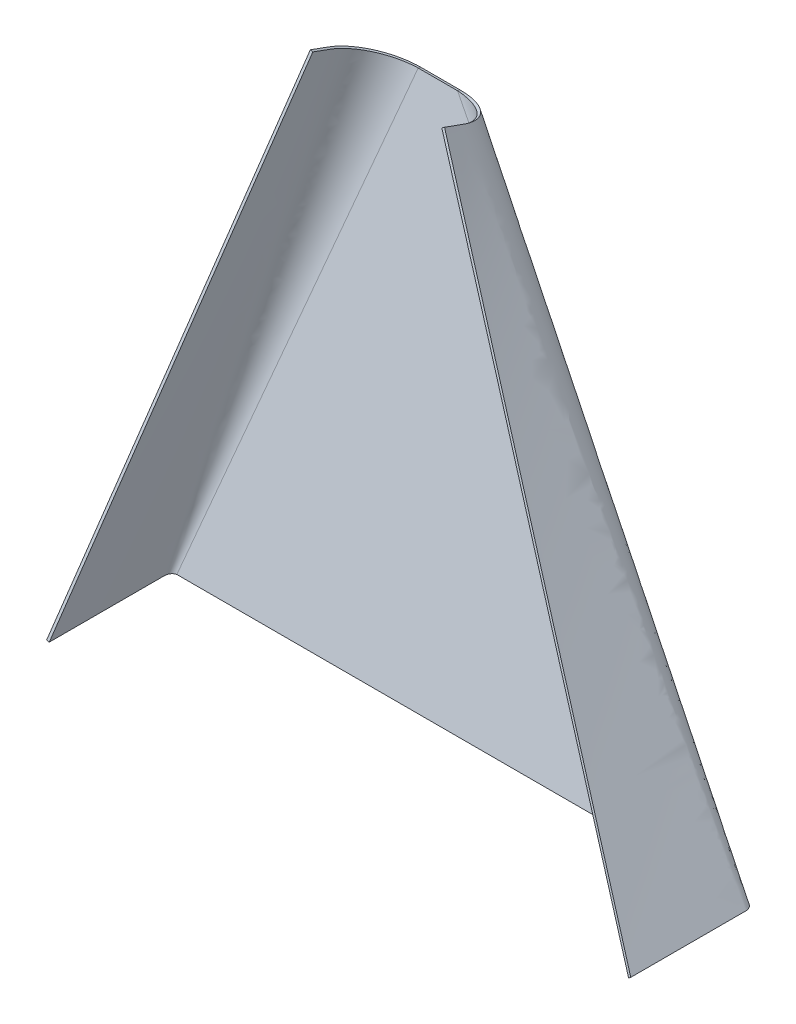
ISO-10303-21;
HEADER;
FILE_DESCRIPTION(('STEP AP214'),'2;1');
FILE_NAME('part.step','',(''),(''),'','','');
FILE_SCHEMA(('AUTOMOTIVE_DESIGN { 1 0 10303 214 1 1 1 1 }'));
ENDSEC;
DATA;
#1=APPLICATION_CONTEXT('core data for automotive mechanical design processes');
#2=APPLICATION_PROTOCOL_DEFINITION('international standard','automotive_design',2000,#1);
#3=PRODUCT_CONTEXT('',#1,'mechanical');
#4=PRODUCT('Part','Part','',(#3));
#5=PRODUCT_RELATED_PRODUCT_CATEGORY('part','',(#4));
#6=PRODUCT_DEFINITION_FORMATION('','',#4);
#7=PRODUCT_DEFINITION_CONTEXT('part definition',#1,'design');
#8=PRODUCT_DEFINITION('design','',#6,#7);
#9=PRODUCT_DEFINITION_SHAPE('','',#8);
#10=(LENGTH_UNIT() NAMED_UNIT(*) SI_UNIT(.MILLI.,.METRE.));
#11=(NAMED_UNIT(*) PLANE_ANGLE_UNIT() SI_UNIT($,.RADIAN.));
#12=(NAMED_UNIT(*) SI_UNIT($,.STERADIAN.) SOLID_ANGLE_UNIT());
#13=UNCERTAINTY_MEASURE_WITH_UNIT(LENGTH_MEASURE(1.E-05),#10,'distance_accuracy_value','');
#14=(GEOMETRIC_REPRESENTATION_CONTEXT(3) GLOBAL_UNCERTAINTY_ASSIGNED_CONTEXT((#13)) GLOBAL_UNIT_ASSIGNED_CONTEXT((#10,
#11,#12)) REPRESENTATION_CONTEXT('',''));
#15=CARTESIAN_POINT('',(0.,0.,0.));
#16=DIRECTION('',(0.,0.,1.));
#17=DIRECTION('',(1.,0.,0.));
#18=AXIS2_PLACEMENT_3D('',#15,#16,#17);
#19=CARTESIAN_POINT('',(-316.5,0.,-138.5));
#20=CARTESIAN_POINT('',(-317.089255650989,0.,-138.5));
#21=CARTESIAN_POINT('',(-317.700547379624,0.,-138.447616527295));
#22=CARTESIAN_POINT('',(-318.938713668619,0.,-138.218490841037));
#23=CARTESIAN_POINT('',(-319.565462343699,0.,-138.041547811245));
#24=CARTESIAN_POINT('',(-320.796431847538,0.,-137.554218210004));
#25=CARTESIAN_POINT('',(-321.4004031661,0.,-137.243716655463));
#26=CARTESIAN_POINT('',(-322.543791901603,0.,-136.49619356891));
#27=CARTESIAN_POINT('',(-323.082912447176,0.,-136.059223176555));
#28=CARTESIAN_POINT('',(-324.059223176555,0.,-135.082912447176));
#29=CARTESIAN_POINT('',(-324.49619356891,0.,-134.543791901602));
#30=CARTESIAN_POINT('',(-325.243716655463,0.,-133.4004031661));
#31=CARTESIAN_POINT('',(-325.554218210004,0.,-132.796431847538));
#32=CARTESIAN_POINT('',(-326.041547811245,0.,-131.565462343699));
#33=CARTESIAN_POINT('',(-326.218490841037,0.,-130.938713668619));
#34=CARTESIAN_POINT('',(-326.39033510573,0.,-130.010088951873));
#35=CARTESIAN_POINT('',(-326.432071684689,0.,-129.70249523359));
#36=CARTESIAN_POINT('',(-326.47319602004,0.,-129.246697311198));
#37=CARTESIAN_POINT('',(-326.483324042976,0.,-129.095696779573));
#38=CARTESIAN_POINT('',(-326.493375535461,0.,-128.870928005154));
#39=CARTESIAN_POINT('',(-326.495869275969,0.,-128.79629375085));
#40=CARTESIAN_POINT('',(-326.497939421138,0.,-128.703396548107));
#41=CARTESIAN_POINT('',(-326.498301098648,0.,-128.685209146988));
#42=CARTESIAN_POINT('',(-326.498920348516,0.,-128.64719961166));
#43=CARTESIAN_POINT('',(-326.499177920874,0.,-128.625888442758));
#44=CARTESIAN_POINT('',(-326.49979537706,0.,-128.520137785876));
#45=CARTESIAN_POINT('',(-326.5,0.,-128.393881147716));
#46=CARTESIAN_POINT('',(-326.5,0.,-127.018511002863));
#47=CARTESIAN_POINT('',(-326.5,0.,-125.76931141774));
#48=CARTESIAN_POINT('',(-326.5,0.,-123.811753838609));
#49=CARTESIAN_POINT('',(-326.5,0.,-123.145274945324));
#50=CARTESIAN_POINT('',(-326.5,0.,-121.80766392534));
#51=CARTESIAN_POINT('',(-326.5,0.,-121.138020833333));
#52=CARTESIAN_POINT('',(-326.5,0.,-117.791666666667));
#53=CARTESIAN_POINT('',(-326.5,0.,-115.114583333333));
#54=CARTESIAN_POINT('',(-326.5,0.,-107.083333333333));
#55=CARTESIAN_POINT('',(-326.5,0.,-101.729166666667));
#56=CARTESIAN_POINT('',(-326.5,0.,-85.6666666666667));
#57=CARTESIAN_POINT('',(-326.5,0.,-74.9583333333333));
#58=CARTESIAN_POINT('',(-326.5,0.,-42.8333333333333));
#59=CARTESIAN_POINT('',(-326.5,0.,-21.4166666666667));
#60=CARTESIAN_POINT('',(-326.5,0.,0.));
#61=CARTESIAN_POINT('',(-316.5,0.719179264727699,-135.587478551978));
#62=CARTESIAN_POINT('',(-316.916314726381,0.67184441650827,-135.575790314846));
#63=CARTESIAN_POINT('',(-317.350265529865,0.620454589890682,-135.526883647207));
#64=CARTESIAN_POINT('',(-318.216650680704,0.50656904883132,-135.344407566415));
#65=CARTESIAN_POINT('',(-318.658190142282,0.446779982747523,-135.209405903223));
#66=CARTESIAN_POINT('',(-319.513152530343,0.318043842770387,-134.853139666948));
#67=CARTESIAN_POINT('',(-319.937210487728,0.25284105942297,-134.627904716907));
#68=CARTESIAN_POINT('',(-320.729982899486,0.117399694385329,-134.099602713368));
#69=CARTESIAN_POINT('',(-321.109358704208,0.0514171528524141,-133.789738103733));
#70=CARTESIAN_POINT('',(-321.790185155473,-0.0802311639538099,-133.109805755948));
#71=CARTESIAN_POINT('',(-322.100413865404,-0.141859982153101,-132.731014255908));
#72=CARTESIAN_POINT('',(-322.62878643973,-0.259760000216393,-131.937285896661));
#73=CARTESIAN_POINT('',(-322.852755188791,-0.312848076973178,-131.513453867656));
#74=CARTESIAN_POINT('',(-323.204938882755,-0.410218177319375,-130.655968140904));
#75=CARTESIAN_POINT('',(-323.336140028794,-0.452438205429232,-130.214971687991));
#76=CARTESIAN_POINT('',(-323.465943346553,-0.508074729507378,-129.564101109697));
#77=CARTESIAN_POINT('',(-323.498352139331,-0.525050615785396,-129.347633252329));
#78=CARTESIAN_POINT('',(-323.531637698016,-0.548428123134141,-129.026379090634));
#79=CARTESIAN_POINT('',(-323.540180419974,-0.555873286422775,-128.919874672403));
#80=CARTESIAN_POINT('',(-323.549311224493,-0.566554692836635,-128.761375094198));
#81=CARTESIAN_POINT('',(-323.551741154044,-0.570034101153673,-128.708751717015));
#82=CARTESIAN_POINT('',(-323.554028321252,-0.574285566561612,-128.643277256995));
#83=CARTESIAN_POINT('',(-323.554407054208,-0.574718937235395,-128.627991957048));
#84=CARTESIAN_POINT('',(-323.555290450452,-0.577609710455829,-128.608497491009));
#85=CARTESIAN_POINT('',(-323.555834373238,-0.579810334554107,-128.601291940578));
#86=CARTESIAN_POINT('',(-323.556992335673,-0.583206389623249,-128.517777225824));
#87=CARTESIAN_POINT('',(-323.557293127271,-0.583503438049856,-128.393881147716));
#88=CARTESIAN_POINT('',(-323.557262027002,-0.58334658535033,-127.018511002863));
#89=CARTESIAN_POINT('',(-323.5572422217,-0.583246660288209,-125.76931141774));
#90=CARTESIAN_POINT('',(-323.55721536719,-0.583111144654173,-123.811753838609));
#91=CARTESIAN_POINT('',(-323.557206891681,-0.583068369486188,-123.145274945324));
#92=CARTESIAN_POINT('',(-323.557190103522,-0.582983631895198,-121.80766392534));
#93=CARTESIAN_POINT('',(-323.557181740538,-0.582941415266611,-121.138020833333));
#94=CARTESIAN_POINT('',(-323.557139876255,-0.58273005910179,-117.791666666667));
#95=CARTESIAN_POINT('',(-323.557106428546,-0.5825611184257,-115.114583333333));
#96=CARTESIAN_POINT('',(-323.557006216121,-0.582054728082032,-107.083333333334));
#97=CARTESIAN_POINT('',(-323.556939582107,-0.581717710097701,-101.729166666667));
#98=CARTESIAN_POINT('',(-323.556740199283,-0.580708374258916,-85.6666666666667));
#99=CARTESIAN_POINT('',(-323.556607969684,-0.580037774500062,-74.9583333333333));
#100=CARTESIAN_POINT('',(-323.556213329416,-0.578032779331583,-42.8333333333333));
#101=CARTESIAN_POINT('',(-323.55595296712,-0.576705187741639,-21.4166666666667));
#102=CARTESIAN_POINT('',(-323.555695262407,-0.575386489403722,0.));
#103=B_SPLINE_SURFACE_WITH_KNOTS('',1,3,((#19,#20,#21,#22,#23,#24,#25,#26,#27,#28,#29,#30,#31,
#32,#33,#34,#35,#36,#37,#38,#39,#40,#41,#42,#43,#44,#45,#46,#47,#48,#49,#50,#51,#52,#53,#54,#55,
#56,#57,#58,#59,#60),(#61,#62,#63,#64,#65,#66,#67,#68,#69,#70,#71,#72,#73,#74,#75,#76,#77,#78,
#79,#80,#81,#82,#83,#84,#85,#86,#87,#88,#89,#90,#91,#92,#93,#94,#95,#96,#97,#98,#99,#100,#101,
#102)),.UNSPECIFIED.,.F.,.F.,.F.,(2,2),(4,2,2,2,2,2,2,2,2,2,2,2,2,2,2,2,2,2,2,2,4),(0.,1.),(0.,
0.0625,0.125,0.1875,0.25,0.3125,0.375,0.4375,0.46875,0.484375,0.4921875,0.494140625,0.49609375,
0.5,0.515625,0.5234375,0.53125,0.5625,0.625,0.75,1.),.UNSPECIFIED.);
#104=CARTESIAN_POINT('',(-316.5,0.,-138.5));
#105=CARTESIAN_POINT('',(-316.5,0.719179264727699,-135.587478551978));
#106=B_SPLINE_CURVE_WITH_KNOTS('',1,(#104,#105),.UNSPECIFIED.,.F.,.F.,(2,2),(0.,1.),.UNSPECIFIED.);
#107=CARTESIAN_POINT('',(-316.5,0.719179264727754,-135.587478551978));
#108=VERTEX_POINT('',#107);
#109=CARTESIAN_POINT('',(-316.5,0.,-138.5));
#110=VERTEX_POINT('',#109);
#111=EDGE_CURVE('E14',#108,#110,#106,.F.);
#112=CARTESIAN_POINT('',(-316.5,0.719179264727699,-135.587478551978));
#113=CARTESIAN_POINT('',(-316.916314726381,0.67184441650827,-135.575790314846));
#114=CARTESIAN_POINT('',(-317.350265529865,0.620454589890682,-135.526883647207));
#115=CARTESIAN_POINT('',(-318.216650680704,0.50656904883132,-135.344407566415));
#116=CARTESIAN_POINT('',(-318.658190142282,0.446779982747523,-135.209405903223));
#117=CARTESIAN_POINT('',(-319.513152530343,0.318043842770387,-134.853139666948));
#118=CARTESIAN_POINT('',(-319.937210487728,0.25284105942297,-134.627904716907));
#119=CARTESIAN_POINT('',(-320.729982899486,0.117399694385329,-134.099602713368));
#120=CARTESIAN_POINT('',(-321.109358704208,0.0514171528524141,-133.789738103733));
#121=CARTESIAN_POINT('',(-321.790185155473,-0.0802311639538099,-133.109805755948));
#122=CARTESIAN_POINT('',(-322.100413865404,-0.141859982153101,-132.731014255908));
#123=CARTESIAN_POINT('',(-322.62878643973,-0.259760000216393,-131.937285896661));
#124=CARTESIAN_POINT('',(-322.852755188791,-0.312848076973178,-131.513453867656));
#125=CARTESIAN_POINT('',(-323.204938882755,-0.410218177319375,-130.655968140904));
#126=CARTESIAN_POINT('',(-323.336140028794,-0.452438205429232,-130.214971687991));
#127=CARTESIAN_POINT('',(-323.465943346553,-0.508074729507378,-129.564101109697));
#128=CARTESIAN_POINT('',(-323.498352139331,-0.525050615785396,-129.347633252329));
#129=CARTESIAN_POINT('',(-323.531637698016,-0.548428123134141,-129.026379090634));
#130=CARTESIAN_POINT('',(-323.540180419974,-0.555873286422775,-128.919874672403));
#131=CARTESIAN_POINT('',(-323.549311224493,-0.566554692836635,-128.761375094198));
#132=CARTESIAN_POINT('',(-323.551741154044,-0.570034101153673,-128.708751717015));
#133=CARTESIAN_POINT('',(-323.554028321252,-0.574285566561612,-128.643277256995));
#134=CARTESIAN_POINT('',(-323.554407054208,-0.574718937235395,-128.627991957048));
#135=CARTESIAN_POINT('',(-323.555290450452,-0.577609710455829,-128.608497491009));
#136=CARTESIAN_POINT('',(-323.555834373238,-0.579810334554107,-128.601291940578));
#137=CARTESIAN_POINT('',(-323.556992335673,-0.583206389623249,-128.517777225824));
#138=CARTESIAN_POINT('',(-323.557293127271,-0.583503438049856,-128.393881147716));
#139=CARTESIAN_POINT('',(-323.557262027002,-0.58334658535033,-127.018511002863));
#140=CARTESIAN_POINT('',(-323.5572422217,-0.583246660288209,-125.76931141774));
#141=CARTESIAN_POINT('',(-323.55721536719,-0.583111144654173,-123.811753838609));
#142=CARTESIAN_POINT('',(-323.557206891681,-0.583068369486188,-123.145274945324));
#143=CARTESIAN_POINT('',(-323.557190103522,-0.582983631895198,-121.80766392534));
#144=CARTESIAN_POINT('',(-323.557181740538,-0.582941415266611,-121.138020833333));
#145=CARTESIAN_POINT('',(-323.557139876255,-0.58273005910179,-117.791666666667));
#146=CARTESIAN_POINT('',(-323.557106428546,-0.5825611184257,-115.114583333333));
#147=CARTESIAN_POINT('',(-323.557006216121,-0.582054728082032,-107.083333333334));
#148=CARTESIAN_POINT('',(-323.556939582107,-0.581717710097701,-101.729166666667));
#149=CARTESIAN_POINT('',(-323.556740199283,-0.580708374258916,-85.6666666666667));
#150=CARTESIAN_POINT('',(-323.556607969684,-0.580037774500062,-74.9583333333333));
#151=CARTESIAN_POINT('',(-323.556213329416,-0.578032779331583,-42.8333333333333));
#152=CARTESIAN_POINT('',(-323.55595296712,-0.576705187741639,-21.4166666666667));
#153=CARTESIAN_POINT('',(-323.555695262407,-0.575386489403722,0.));
#154=B_SPLINE_CURVE_WITH_KNOTS('',3,(#112,#113,#114,#115,#116,#117,#118,#119,#120,#121,#122,
#123,#124,#125,#126,#127,#128,#129,#130,#131,#132,#133,#134,#135,#136,#137,#138,#139,#140,#141,
#142,#143,#144,#145,#146,#147,#148,#149,#150,#151,#152,#153),.UNSPECIFIED.,.F.,.F.,(4,2,2,2,2,2,
2,2,2,2,2,2,2,2,2,2,2,2,2,2,4),(0.,0.0625,0.125,0.1875,0.25,0.3125,0.375,0.4375,0.46875,
0.484375,0.4921875,0.494140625,0.49609375,0.5,0.515625,0.5234375,0.53125,0.5625,0.625,0.75,1.),.UNSPECIFIED.);
#155=CARTESIAN_POINT('',(-323.555695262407,-0.575386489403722,0.));
#156=VERTEX_POINT('',#155);
#157=EDGE_CURVE('E426',#108,#156,#154,.T.);
#158=CARTESIAN_POINT('',(-323.555695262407,-0.575386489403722,0.));
#159=CARTESIAN_POINT('',(-326.5,0.,0.));
#160=B_SPLINE_CURVE_WITH_KNOTS('',1,(#158,#159),.UNSPECIFIED.,.F.,.F.,(2,2),(0.,1.),.UNSPECIFIED.);
#161=CARTESIAN_POINT('',(-326.5,0.,0.));
#162=VERTEX_POINT('',#161);
#163=EDGE_CURVE('E86',#156,#162,#160,.T.);
#164=CARTESIAN_POINT('',(-316.5,0.,-138.5));
#165=CARTESIAN_POINT('',(-317.089255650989,0.,-138.5));
#166=CARTESIAN_POINT('',(-317.700547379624,0.,-138.447616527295));
#167=CARTESIAN_POINT('',(-318.938713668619,0.,-138.218490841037));
#168=CARTESIAN_POINT('',(-319.565462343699,0.,-138.041547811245));
#169=CARTESIAN_POINT('',(-320.796431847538,0.,-137.554218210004));
#170=CARTESIAN_POINT('',(-321.4004031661,0.,-137.243716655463));
#171=CARTESIAN_POINT('',(-322.543791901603,0.,-136.49619356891));
#172=CARTESIAN_POINT('',(-323.082912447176,0.,-136.059223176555));
#173=CARTESIAN_POINT('',(-324.059223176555,0.,-135.082912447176));
#174=CARTESIAN_POINT('',(-324.49619356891,0.,-134.543791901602));
#175=CARTESIAN_POINT('',(-325.243716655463,0.,-133.4004031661));
#176=CARTESIAN_POINT('',(-325.554218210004,0.,-132.796431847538));
#177=CARTESIAN_POINT('',(-326.041547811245,0.,-131.565462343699));
#178=CARTESIAN_POINT('',(-326.218490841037,0.,-130.938713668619));
#179=CARTESIAN_POINT('',(-326.424703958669,0.,-129.824364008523));
#180=CARTESIAN_POINT('',(-326.47980040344,0.,-129.303441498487));
#181=CARTESIAN_POINT('',(-326.496565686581,0.,-128.766554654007));
#182=CARTESIAN_POINT('',(-326.499214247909,0.,-128.647644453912));
#183=CARTESIAN_POINT('',(-326.5,0.,-128.558925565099));
#184=CARTESIAN_POINT('',(-326.5,0.,-126.358333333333));
#185=CARTESIAN_POINT('',(-326.5,0.,-122.075));
#186=CARTESIAN_POINT('',(-326.5,0.,-115.65));
#187=CARTESIAN_POINT('',(-326.5,0.,-109.225));
#188=CARTESIAN_POINT('',(-326.5,0.,-70.675));
#189=CARTESIAN_POINT('',(-326.5,0.,-34.2666666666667));
#190=CARTESIAN_POINT('',(-326.5,0.,0.));
#191=B_SPLINE_CURVE_WITH_KNOTS('',3,(#164,#165,#166,#167,#168,#169,#170,#171,#172,#173,#174,
#175,#176,#177,#178,#179,#180,#181,#182,#183,#184,#185,#186,#187,#188,#189,#190),.UNSPECIFIED.,
.F.,.F.,(4,2,2,2,2,2,2,2,1,1,1,2,1,1,1,1,4),(0.,0.0625,0.125,0.1875,0.25,0.3125,0.375,0.4375,
0.4875,0.490625,0.49375,0.5,0.525,0.55,0.575,0.6,1.),.UNSPECIFIED.);
#192=EDGE_CURVE('E384',#110,#162,#191,.T.);
#193=ORIENTED_EDGE('',*,*,#111,.F.);
#194=ORIENTED_EDGE('',*,*,#157,.T.);
#195=ORIENTED_EDGE('',*,*,#163,.T.);
#196=ORIENTED_EDGE('',*,*,#192,.F.);
#197=EDGE_LOOP('',(#193,#194,#195,#196));
#198=FACE_BOUND('',#197,.T.);
#199=ADVANCED_FACE('F74',(#198),#103,.T.);
#200=CARTESIAN_POINT('',(-326.5,0.,0.));
#201=CARTESIAN_POINT('',(-309.333333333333,87.8433868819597,-31.9723781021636));
#202=CARTESIAN_POINT('',(-292.166666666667,175.686773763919,-63.9447562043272));
#203=CARTESIAN_POINT('',(-266.416666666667,307.451854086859,-111.903323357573));
#204=CARTESIAN_POINT('',(-257.833333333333,351.373547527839,-127.889512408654));
#205=CARTESIAN_POINT('',(-244.958333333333,417.256087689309,-151.868795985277));
#206=CARTESIAN_POINT('',(-240.666666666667,439.216934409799,-159.861890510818));
#207=CARTESIAN_POINT('',(-232.083333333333,483.138627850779,-175.8480795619));
#208=CARTESIAN_POINT('',(-227.791666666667,505.099474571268,-183.841174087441));
#209=CARTESIAN_POINT('',(-223.5,527.060321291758,-191.834268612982));
#210=CARTESIAN_POINT('',(-323.555695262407,-0.575386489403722,0.));
#211=CARTESIAN_POINT('',(-306.388643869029,87.269969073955,-31.9667627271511));
#212=CARTESIAN_POINT('',(-289.221491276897,175.115740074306,-63.9323295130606));
#213=CARTESIAN_POINT('',(-263.470091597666,306.889331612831,-111.866760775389));
#214=CARTESIAN_POINT('',(-254.886170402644,350.814568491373,-127.842898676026));
#215=CARTESIAN_POINT('',(-242.009917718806,416.707140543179,-151.79394726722));
#216=CARTESIAN_POINT('',(-237.717762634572,438.672107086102,-159.775460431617));
#217=CARTESIAN_POINT('',(-229.133378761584,482.60626338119,-175.726844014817));
#218=CARTESIAN_POINT('',(-224.841006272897,504.574874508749,-183.698232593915));
#219=CARTESIAN_POINT('',(-220.549339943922,526.551145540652,-191.648943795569));
#220=B_SPLINE_SURFACE_WITH_KNOTS('',1,3,((#200,#201,#202,#203,#204,#205,#206,#207,#208,#209),
(#210,#211,#212,#213,#214,#215,#216,#217,#218,#219)),.UNSPECIFIED.,.F.,.F.,.F.,(2,2),(4,2,2,2,
4),(0.,1.),(-0.285132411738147,0.,0.142566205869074,0.21384930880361,0.285132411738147),.UNSPECIFIED.);
#221=CARTESIAN_POINT('',(-323.555695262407,-0.575386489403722,0.));
#222=CARTESIAN_POINT('',(-306.388643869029,87.269969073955,-31.9667627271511));
#223=CARTESIAN_POINT('',(-289.221491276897,175.115740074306,-63.9323295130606));
#224=CARTESIAN_POINT('',(-263.470091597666,306.889331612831,-111.866760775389));
#225=CARTESIAN_POINT('',(-254.886170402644,350.814568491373,-127.842898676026));
#226=CARTESIAN_POINT('',(-242.009917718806,416.707140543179,-151.79394726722));
#227=CARTESIAN_POINT('',(-237.717762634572,438.672107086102,-159.775460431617));
#228=CARTESIAN_POINT('',(-229.133378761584,482.60626338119,-175.726844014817));
#229=CARTESIAN_POINT('',(-224.841006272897,504.574874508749,-183.698232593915));
#230=CARTESIAN_POINT('',(-220.549339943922,526.551145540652,-191.648943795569));
#231=B_SPLINE_CURVE_WITH_KNOTS('',3,(#221,#222,#223,#224,#225,#226,#227,#228,#229,#230),
.UNSPECIFIED.,.F.,.F.,(4,2,2,2,4),(-0.285132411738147,0.,0.142566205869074,0.21384930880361,
0.285132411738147),.UNSPECIFIED.);
#232=CARTESIAN_POINT('',(-220.549339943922,526.551145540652,-191.648943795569));
#233=VERTEX_POINT('',#232);
#234=EDGE_CURVE('E529',#156,#233,#231,.T.);
#235=CARTESIAN_POINT('',(-220.549339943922,526.551145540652,-191.648943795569));
#236=CARTESIAN_POINT('',(-223.5,527.060321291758,-191.834268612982));
#237=B_SPLINE_CURVE_WITH_KNOTS('',1,(#235,#236),.UNSPECIFIED.,.F.,.F.,(2,2),(0.,1.),.UNSPECIFIED.);
#238=CARTESIAN_POINT('',(-223.5,527.060321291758,-191.834268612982));
#239=VERTEX_POINT('',#238);
#240=EDGE_CURVE('E533',#233,#239,#237,.T.);
#241=CARTESIAN_POINT('',(-326.5,0.,0.));
#242=CARTESIAN_POINT('',(-223.5,527.060321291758,-191.834268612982));
#243=B_SPLINE_CURVE_WITH_KNOTS('',1,(#241,#242),.UNSPECIFIED.,.F.,.F.,(2,2),(0.,1.),.UNSPECIFIED.);
#244=EDGE_CURVE('E516',#162,#239,#243,.T.);
#245=ORIENTED_EDGE('',*,*,#163,.F.);
#246=ORIENTED_EDGE('',*,*,#234,.T.);
#247=ORIENTED_EDGE('',*,*,#240,.T.);
#248=ORIENTED_EDGE('',*,*,#244,.F.);
#249=EDGE_LOOP('',(#245,#246,#247,#248));
#250=FACE_BOUND('',#249,.T.);
#251=ADVANCED_FACE('F278',(#250),#220,.T.);
#252=CARTESIAN_POINT('',(-170.5,501.408810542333,-262.311215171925));
#253=CARTESIAN_POINT('',(-173.62305495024,501.408810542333,-262.311215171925));
#254=CARTESIAN_POINT('',(-176.862901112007,501.503766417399,-262.050326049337));
#255=CARTESIAN_POINT('',(-183.425182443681,501.919104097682,-260.90919515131));
#256=CARTESIAN_POINT('',(-186.746950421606,502.239849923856,-260.027953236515));
#257=CARTESIAN_POINT('',(-193.271088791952,503.12323558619,-257.60087107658));
#258=CARTESIAN_POINT('',(-196.472136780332,503.686083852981,-256.054458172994));
#259=CARTESIAN_POINT('',(-202.532097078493,505.041124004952,-252.331515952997));
#260=CARTESIAN_POINT('',(-205.389435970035,505.833223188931,-250.155241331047));
#261=CARTESIAN_POINT('',(-210.563882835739,507.60298824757,-245.292851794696));
#262=CARTESIAN_POINT('',(-212.879825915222,508.580255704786,-242.607831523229));
#263=CARTESIAN_POINT('',(-216.841698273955,510.65288419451,-236.913331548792));
#264=CARTESIAN_POINT('',(-218.487356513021,511.747707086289,-233.90533037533));
#265=CARTESIAN_POINT('',(-221.070203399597,513.979093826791,-227.77464569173));
#266=CARTESIAN_POINT('',(-222.008001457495,515.115205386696,-224.65320483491));
#267=CARTESIAN_POINT('',(-222.91877606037,516.798529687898,-220.028309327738));
#268=CARTESIAN_POINT('',(-223.13997992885,517.356106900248,-218.496378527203));
#269=CARTESIAN_POINT('',(-223.357938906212,518.182334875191,-216.226335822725));
#270=CARTESIAN_POINT('',(-223.411617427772,518.456054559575,-215.47429717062));
#271=CARTESIAN_POINT('',(-223.464890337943,518.863494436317,-214.354865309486));
#272=CARTESIAN_POINT('',(-223.478107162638,518.998784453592,-213.983159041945));
#273=CARTESIAN_POINT('',(-223.489078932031,519.167179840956,-213.520496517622));
#274=CARTESIAN_POINT('',(-223.490995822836,519.200882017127,-213.427900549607));
#275=CARTESIAN_POINT('',(-223.494277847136,519.267947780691,-213.243638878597));
#276=CARTESIAN_POINT('',(-223.495642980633,519.301075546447,-213.152621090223));
#277=CARTESIAN_POINT('',(-223.497824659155,519.362834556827,-212.982939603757));
#278=CARTESIAN_POINT('',(-223.498641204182,519.39146580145,-212.904275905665));
#279=CARTESIAN_POINT('',(-223.499456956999,519.428275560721,-212.803141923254));
#280=CARTESIAN_POINT('',(-223.49966069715,519.4395226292,-212.772240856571));
#281=CARTESIAN_POINT('',(-223.499864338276,519.454513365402,-212.731054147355));
#282=CARTESIAN_POINT('',(-223.499915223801,519.459196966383,-212.718186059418));
#283=CARTESIAN_POINT('',(-223.499983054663,519.467879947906,-212.694329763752));
#284=CARTESIAN_POINT('',(-223.5,519.471879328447,-212.683341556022));
#285=CARTESIAN_POINT('',(-223.5,519.591618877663,-212.354359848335));
#286=CARTESIAN_POINT('',(-223.5,519.684147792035,-212.100138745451));
#287=CARTESIAN_POINT('',(-223.5,519.851518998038,-211.640290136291));
#288=CARTESIAN_POINT('',(-223.5,519.927776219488,-211.430775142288));
#289=CARTESIAN_POINT('',(-223.5,520.162915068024,-210.784736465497));
#290=CARTESIAN_POINT('',(-223.5,520.319674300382,-210.354044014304));
#291=CARTESIAN_POINT('',(-223.5,520.789951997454,-209.061966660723));
#292=CARTESIAN_POINT('',(-223.5,521.10347046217,-208.200581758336));
#293=CARTESIAN_POINT('',(-223.5,522.044025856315,-205.616427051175));
#294=CARTESIAN_POINT('',(-223.5,522.671062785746,-203.893657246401));
#295=CARTESIAN_POINT('',(-223.5,524.552173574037,-198.725347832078));
#296=CARTESIAN_POINT('',(-223.5,525.806247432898,-195.27980822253));
#297=CARTESIAN_POINT('',(-223.5,527.060321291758,-191.834268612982));
#298=CARTESIAN_POINT('',(-170.5,502.127989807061,-259.398693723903));
#299=CARTESIAN_POINT('',(-173.445922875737,502.079479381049,-259.386715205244));
#300=CARTESIAN_POINT('',(-176.507260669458,502.122615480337,-259.130049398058));
#301=CARTESIAN_POINT('',(-182.702081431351,502.425319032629,-258.035462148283));
#302=CARTESIAN_POINT('',(-185.844048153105,502.687965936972,-257.195276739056));
#303=CARTESIAN_POINT('',(-192.007734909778,503.448257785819,-254.891924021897));
#304=CARTESIAN_POINT('',(-195.038531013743,503.949682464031,-253.424500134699));
#305=CARTESIAN_POINT('',(-200.767195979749,505.178025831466,-249.90092528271));
#306=CARTESIAN_POINT('',(-203.473789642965,505.90880040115,-247.838795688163));
#307=CARTESIAN_POINT('',(-208.365704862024,507.555633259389,-243.241729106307));
#308=CARTESIAN_POINT('',(-210.558427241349,508.475014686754,-240.6999249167));
#309=CARTESIAN_POINT('',(-214.300749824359,510.435149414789,-235.320771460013));
#310=CARTESIAN_POINT('',(-215.855966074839,511.478354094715,-232.476673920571));
#311=CARTESIAN_POINT('',(-218.289672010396,513.612807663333,-226.691915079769));
#312=CARTESIAN_POINT('',(-219.171958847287,514.705620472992,-223.745509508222));
#313=CARTESIAN_POINT('',(-220.024074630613,516.330271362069,-219.387887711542));
#314=CARTESIAN_POINT('',(-220.230165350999,516.869632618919,-217.944565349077));
#315=CARTESIAN_POINT('',(-220.431533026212,517.670378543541,-215.806701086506));
#316=CARTESIAN_POINT('',(-220.480695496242,517.935910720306,-215.098604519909));
#317=CARTESIAN_POINT('',(-220.528661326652,518.331505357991,-214.044951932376));
#318=CARTESIAN_POINT('',(-220.540353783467,518.462919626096,-213.695150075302));
#319=CARTESIAN_POINT('',(-220.549721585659,518.626558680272,-213.259847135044));
#320=CARTESIAN_POINT('',(-220.551320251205,518.659272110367,-213.172962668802));
#321=CARTESIAN_POINT('',(-220.554057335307,518.724574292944,-212.998943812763));
#322=CARTESIAN_POINT('',(-220.555202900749,518.756959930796,-212.91226954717));
#323=CARTESIAN_POINT('',(-220.556969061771,518.817286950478,-212.75106745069));
#324=CARTESIAN_POINT('',(-220.557593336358,518.84524365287,-212.676450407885));
#325=CARTESIAN_POINT('',(-220.558071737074,518.880816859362,-212.582804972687));
#326=CARTESIAN_POINT('',(-220.558154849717,518.891614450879,-212.554635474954));
#327=CARTESIAN_POINT('',(-220.558141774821,518.905756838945,-212.518597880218));
#328=CARTESIAN_POINT('',(-220.558114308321,518.910127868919,-212.507625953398));
#329=CARTESIAN_POINT('',(-220.558004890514,518.918078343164,-212.48820423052));
#330=CARTESIAN_POINT('',(-220.557809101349,518.921125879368,-212.482883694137));
#331=CARTESIAN_POINT('',(-220.55772482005,519.041263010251,-212.154046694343));
#332=CARTESIAN_POINT('',(-220.557632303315,519.134228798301,-211.899984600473));
#333=CARTESIAN_POINT('',(-220.557439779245,519.302510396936,-211.440467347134));
#334=CARTESIAN_POINT('',(-220.557340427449,519.379238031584,-211.231123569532));
#335=CARTESIAN_POINT('',(-220.557046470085,519.615770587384,-210.585592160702));
#336=CARTESIAN_POINT('',(-220.556851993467,519.77345432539,-210.155236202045));
#337=CARTESIAN_POINT('',(-220.556272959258,520.246491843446,-208.864163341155));
#338=CARTESIAN_POINT('',(-220.55589279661,520.561831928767,-208.003441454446));
#339=CARTESIAN_POINT('',(-220.554769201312,521.507798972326,-205.42125642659));
#340=CARTESIAN_POINT('',(-220.554042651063,522.138372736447,-203.699773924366));
#341=CARTESIAN_POINT('',(-220.551925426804,524.029893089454,-198.535253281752));
#342=CARTESIAN_POINT('',(-220.550597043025,525.290638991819,-195.092142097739));
#343=CARTESIAN_POINT('',(-220.549339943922,526.551145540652,-191.648943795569));
#344=B_SPLINE_SURFACE_WITH_KNOTS('',1,3,((#252,#253,#254,#255,#256,#257,#258,#259,#260,#261,
#262,#263,#264,#265,#266,#267,#268,#269,#270,#271,#272,#273,#274,#275,#276,#277,#278,#279,#280,
#281,#282,#283,#284,#285,#286,#287,#288,#289,#290,#291,#292,#293,#294,#295,#296,#297),(#298,
#299,#300,#301,#302,#303,#304,#305,#306,#307,#308,#309,#310,#311,#312,#313,#314,#315,#316,#317,
#318,#319,#320,#321,#322,#323,#324,#325,#326,#327,#328,#329,#330,#331,#332,#333,#334,#335,#336,
#337,#338,#339,#340,#341,#342,#343)),.UNSPECIFIED.,.F.,.F.,.F.,(2,2),(4,2,2,2,2,2,2,2,2,2,2,2,2,
2,2,2,2,2,2,2,2,2,4),(0.,1.),(0.,0.0625,0.125,0.1875,0.25,0.3125,0.375,0.4375,0.46875,0.484375,
0.4921875,0.494140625,0.49609375,0.498046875,0.4990234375,0.49951171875,0.5,0.515625,0.53125,
0.5625,0.625,0.75,1.),.UNSPECIFIED.);
#345=CARTESIAN_POINT('',(-220.549339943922,526.551145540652,-191.648943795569));
#346=CARTESIAN_POINT('',(-220.550597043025,525.290638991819,-195.092142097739));
#347=CARTESIAN_POINT('',(-220.551925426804,524.029893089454,-198.535253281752));
#348=CARTESIAN_POINT('',(-220.554042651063,522.138372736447,-203.699773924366));
#349=CARTESIAN_POINT('',(-220.554769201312,521.507798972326,-205.42125642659));
#350=CARTESIAN_POINT('',(-220.55589279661,520.561831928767,-208.003441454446));
#351=CARTESIAN_POINT('',(-220.556272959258,520.246491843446,-208.864163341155));
#352=CARTESIAN_POINT('',(-220.556851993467,519.77345432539,-210.155236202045));
#353=CARTESIAN_POINT('',(-220.557046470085,519.615770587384,-210.585592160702));
#354=CARTESIAN_POINT('',(-220.557340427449,519.379238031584,-211.231123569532));
#355=CARTESIAN_POINT('',(-220.557439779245,519.302510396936,-211.440467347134));
#356=CARTESIAN_POINT('',(-220.557632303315,519.134228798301,-211.899984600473));
#357=CARTESIAN_POINT('',(-220.55772482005,519.041263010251,-212.154046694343));
#358=CARTESIAN_POINT('',(-220.557809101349,518.921125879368,-212.482883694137));
#359=CARTESIAN_POINT('',(-220.558004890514,518.918078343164,-212.48820423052));
#360=CARTESIAN_POINT('',(-220.558114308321,518.910127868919,-212.507625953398));
#361=CARTESIAN_POINT('',(-220.558141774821,518.905756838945,-212.518597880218));
#362=CARTESIAN_POINT('',(-220.558154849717,518.891614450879,-212.554635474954));
#363=CARTESIAN_POINT('',(-220.558071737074,518.880816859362,-212.582804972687));
#364=CARTESIAN_POINT('',(-220.557593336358,518.84524365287,-212.676450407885));
#365=CARTESIAN_POINT('',(-220.556969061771,518.817286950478,-212.75106745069));
#366=CARTESIAN_POINT('',(-220.555202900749,518.756959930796,-212.91226954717));
#367=CARTESIAN_POINT('',(-220.554057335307,518.724574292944,-212.998943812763));
#368=CARTESIAN_POINT('',(-220.551320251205,518.659272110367,-213.172962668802));
#369=CARTESIAN_POINT('',(-220.549721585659,518.626558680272,-213.259847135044));
#370=CARTESIAN_POINT('',(-220.540353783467,518.462919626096,-213.695150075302));
#371=CARTESIAN_POINT('',(-220.528661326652,518.331505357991,-214.044951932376));
#372=CARTESIAN_POINT('',(-220.480695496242,517.935910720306,-215.098604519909));
#373=CARTESIAN_POINT('',(-220.431533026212,517.670378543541,-215.806701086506));
#374=CARTESIAN_POINT('',(-220.230165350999,516.869632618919,-217.944565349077));
#375=CARTESIAN_POINT('',(-220.024074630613,516.330271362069,-219.387887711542));
#376=CARTESIAN_POINT('',(-219.171958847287,514.705620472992,-223.745509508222));
#377=CARTESIAN_POINT('',(-218.289672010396,513.612807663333,-226.691915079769));
#378=CARTESIAN_POINT('',(-215.855966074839,511.478354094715,-232.476673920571));
#379=CARTESIAN_POINT('',(-214.300749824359,510.435149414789,-235.320771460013));
#380=CARTESIAN_POINT('',(-210.558427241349,508.475014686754,-240.6999249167));
#381=CARTESIAN_POINT('',(-208.365704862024,507.555633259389,-243.241729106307));
#382=CARTESIAN_POINT('',(-203.473789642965,505.90880040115,-247.838795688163));
#383=CARTESIAN_POINT('',(-200.767195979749,505.178025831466,-249.90092528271));
#384=CARTESIAN_POINT('',(-195.038531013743,503.949682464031,-253.424500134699));
#385=CARTESIAN_POINT('',(-192.007734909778,503.448257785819,-254.891924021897));
#386=CARTESIAN_POINT('',(-185.844048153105,502.687965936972,-257.195276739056));
#387=CARTESIAN_POINT('',(-182.702081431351,502.425319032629,-258.035462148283));
#388=CARTESIAN_POINT('',(-176.507260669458,502.122615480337,-259.130049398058));
#389=CARTESIAN_POINT('',(-173.445922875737,502.079479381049,-259.386715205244));
#390=CARTESIAN_POINT('',(-170.5,502.127989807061,-259.398693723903));
#391=B_SPLINE_CURVE_WITH_KNOTS('',3,(#345,#346,#347,#348,#349,#350,#351,#352,#353,#354,#355,
#356,#357,#358,#359,#360,#361,#362,#363,#364,#365,#366,#367,#368,#369,#370,#371,#372,#373,#374,
#375,#376,#377,#378,#379,#380,#381,#382,#383,#384,#385,#386,#387,#388,#389,#390),.UNSPECIFIED.,
.F.,.F.,(4,2,2,2,2,2,2,2,2,2,2,2,2,2,2,2,2,2,2,2,2,2,4),(0.,0.25,0.375,0.4375,0.46875,0.484375,
0.5,0.50048828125,0.5009765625,0.501953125,0.50390625,0.505859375,0.5078125,0.515625,0.53125,
0.5625,0.625,0.6875,0.75,0.8125,0.875,0.9375,1.),.UNSPECIFIED.);
#392=CARTESIAN_POINT('',(-170.5,502.127989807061,-259.398693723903));
#393=VERTEX_POINT('',#392);
#394=EDGE_CURVE('E528',#233,#393,#391,.T.);
#395=CARTESIAN_POINT('',(-170.5,502.127989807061,-259.398693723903));
#396=CARTESIAN_POINT('',(-170.5,501.408810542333,-262.311215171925));
#397=B_SPLINE_CURVE_WITH_KNOTS('',1,(#395,#396),.UNSPECIFIED.,.F.,.F.,(2,2),(0.,1.),.UNSPECIFIED.);
#398=CARTESIAN_POINT('',(-170.5,501.408810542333,-262.311215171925));
#399=VERTEX_POINT('',#398);
#400=EDGE_CURVE('E571',#393,#399,#397,.T.);
#401=CARTESIAN_POINT('',(-223.5,527.060321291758,-191.834268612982));
#402=CARTESIAN_POINT('',(-223.5,525.053803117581,-197.347131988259));
#403=CARTESIAN_POINT('',(-223.5,522.921877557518,-203.204549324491));
#404=CARTESIAN_POINT('',(-223.5,520.664544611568,-209.406520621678));
#405=CARTESIAN_POINT('',(-223.5,520.28832245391,-210.440182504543));
#406=CARTESIAN_POINT('',(-223.5,519.912100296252,-211.473844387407));
#407=CARTESIAN_POINT('',(-223.5,519.66128552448,-212.162952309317));
#408=CARTESIAN_POINT('',(-223.5,519.429063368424,-212.800977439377));
#409=CARTESIAN_POINT('',(-223.49583551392,519.268242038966,-213.242830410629));
#410=CARTESIAN_POINT('',(-223.481798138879,519.052692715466,-213.835047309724));
#411=CARTESIAN_POINT('',(-223.392942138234,518.079474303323,-216.508942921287));
#412=CARTESIAN_POINT('',(-223.100930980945,517.135194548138,-219.103330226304));
#413=CARTESIAN_POINT('',(-222.008001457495,515.115205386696,-224.65320483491));
#414=CARTESIAN_POINT('',(-221.070203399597,513.979093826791,-227.77464569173));
#415=CARTESIAN_POINT('',(-218.487356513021,511.747707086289,-233.90533037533));
#416=CARTESIAN_POINT('',(-216.841698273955,510.65288419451,-236.913331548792));
#417=CARTESIAN_POINT('',(-212.879825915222,508.580255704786,-242.607831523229));
#418=CARTESIAN_POINT('',(-210.563882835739,507.60298824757,-245.292851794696));
#419=CARTESIAN_POINT('',(-205.389435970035,505.833223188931,-250.155241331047));
#420=CARTESIAN_POINT('',(-202.532097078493,505.041124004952,-252.331515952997));
#421=CARTESIAN_POINT('',(-196.472136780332,503.686083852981,-256.054458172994));
#422=CARTESIAN_POINT('',(-193.271088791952,503.12323558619,-257.60087107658));
#423=CARTESIAN_POINT('',(-186.746950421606,502.239849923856,-260.027953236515));
#424=CARTESIAN_POINT('',(-183.425182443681,501.919104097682,-260.90919515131));
#425=CARTESIAN_POINT('',(-176.862901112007,501.503766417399,-262.050326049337));
#426=CARTESIAN_POINT('',(-173.623054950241,501.408810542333,-262.311215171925));
#427=CARTESIAN_POINT('',(-170.5,501.408810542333,-262.311215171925));
#428=B_SPLINE_CURVE_WITH_KNOTS('',3,(#401,#402,#403,#404,#405,#406,#407,#408,#409,#410,#411,
#412,#413,#414,#415,#416,#417,#418,#419,#420,#421,#422,#423,#424,#425,#426,#427),.UNSPECIFIED.,
.F.,.F.,(4,1,1,1,1,2,1,1,1,2,2,2,2,2,2,2,4),(0.,0.4,0.425,0.45,0.475,0.5,0.50625,0.509375,
0.5125,0.5625,0.625,0.6875,0.75,0.8125,0.875,0.9375,1.),.UNSPECIFIED.);
#429=EDGE_CURVE('E174',#239,#399,#428,.T.);
#430=ORIENTED_EDGE('',*,*,#240,.F.);
#431=ORIENTED_EDGE('',*,*,#394,.T.);
#432=ORIENTED_EDGE('',*,*,#400,.T.);
#433=ORIENTED_EDGE('',*,*,#429,.F.);
#434=EDGE_LOOP('',(#430,#431,#432,#433));
#435=FACE_BOUND('',#434,.T.);
#436=ADVANCED_FACE('F569',(#435),#344,.F.);
#437=CARTESIAN_POINT('',(-170.5,501.408810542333,-262.311215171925));
#438=DIRECTION('',(0.,0.970840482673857,-0.239726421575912));
#439=DIRECTION('',(1.,0.,0.));
#440=AXIS2_PLACEMENT_3D('',#437,#438,#439);
#441=PLANE('',#440);
#442=ORIENTED_EDGE('',*,*,#400,.F.);
#443=DIRECTION('',(1.,0.,0.));
#444=VECTOR('',#443,1.);
#445=CARTESIAN_POINT('',(-170.5,502.127989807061,-259.398693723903));
#446=LINE('',#445,#444);
#447=CARTESIAN_POINT('',(-126.5,502.127989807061,-259.398693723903));
#448=VERTEX_POINT('',#447);
#449=EDGE_CURVE('E396',#393,#448,#446,.T.);
#450=ORIENTED_EDGE('',*,*,#449,.T.);
#451=CARTESIAN_POINT('',(-126.5,501.408810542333,-262.311215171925));
#452=CARTESIAN_POINT('',(-126.5,502.127989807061,-259.398693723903));
#453=B_SPLINE_CURVE_WITH_KNOTS('',1,(#451,#452),.UNSPECIFIED.,.F.,.F.,(2,2),(0.,1.),.UNSPECIFIED.);
#454=CARTESIAN_POINT('',(-126.5,501.408810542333,-262.311215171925));
#455=VERTEX_POINT('',#454);
#456=EDGE_CURVE('E633',#448,#455,#453,.F.);
#457=ORIENTED_EDGE('',*,*,#456,.T.);
#458=DIRECTION('',(1.,0.,0.));
#459=VECTOR('',#458,1.);
#460=CARTESIAN_POINT('',(-170.5,501.408810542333,-262.311215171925));
#461=LINE('',#460,#459);
#462=EDGE_CURVE('E368',#399,#455,#461,.T.);
#463=ORIENTED_EDGE('',*,*,#462,.F.);
#464=EDGE_LOOP('',(#442,#450,#457,#463));
#465=FACE_BOUND('',#464,.T.);
#466=ADVANCED_FACE('F587',(#465),#441,.T.);
#467=CARTESIAN_POINT('',(-73.5,527.060321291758,-191.834268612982));
#468=CARTESIAN_POINT('',(-73.5,525.806247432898,-195.27980822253));
#469=CARTESIAN_POINT('',(-73.5,524.552173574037,-198.725347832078));
#470=CARTESIAN_POINT('',(-73.5,522.671062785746,-203.893657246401));
#471=CARTESIAN_POINT('',(-73.5,522.044025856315,-205.616427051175));
#472=CARTESIAN_POINT('',(-73.5,521.10347046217,-208.200581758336));
#473=CARTESIAN_POINT('',(-73.5,520.789951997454,-209.061966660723));
#474=CARTESIAN_POINT('',(-73.5,520.319674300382,-210.354044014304));
#475=CARTESIAN_POINT('',(-73.5,520.162915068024,-210.784736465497));
#476=CARTESIAN_POINT('',(-73.5,519.927776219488,-211.430775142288));
#477=CARTESIAN_POINT('',(-73.5,519.851518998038,-211.640290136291));
#478=CARTESIAN_POINT('',(-73.5,519.725990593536,-211.985176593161));
#479=CARTESIAN_POINT('',(-73.5,519.681936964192,-212.106212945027));
#480=CARTESIAN_POINT('',(-73.5,519.60977674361,-212.30447152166));
#481=CARTESIAN_POINT('',(-73.5,519.584710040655,-212.37334172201));
#482=CARTESIAN_POINT('',(-73.5,519.545244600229,-212.481772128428));
#483=CARTESIAN_POINT('',(-73.5,519.531778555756,-212.518769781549));
#484=CARTESIAN_POINT('',(-73.5,519.511069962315,-212.575666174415));
#485=CARTESIAN_POINT('',(-73.5,519.504082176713,-212.594864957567));
#486=CARTESIAN_POINT('',(-73.5,519.4934677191,-212.62402794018));
#487=CARTESIAN_POINT('',(-73.5,519.489907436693,-212.633809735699));
#488=CARTESIAN_POINT('',(-73.5,519.482741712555,-212.653497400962));
#489=CARTESIAN_POINT('',(-73.5,519.479136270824,-212.663403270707));
#490=CARTESIAN_POINT('',(-73.5,519.446480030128,-212.753125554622));
#491=CARTESIAN_POINT('',(-73.5010845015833,519.393714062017,-212.898098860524));
#492=CARTESIAN_POINT('',(-73.5043570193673,519.301075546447,-213.152621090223));
#493=CARTESIAN_POINT('',(-73.5057221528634,519.26794778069,-213.243638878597));
#494=CARTESIAN_POINT('',(-73.5090041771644,519.200882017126,-213.427900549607));
#495=CARTESIAN_POINT('',(-73.5109210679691,519.167179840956,-213.520496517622));
#496=CARTESIAN_POINT('',(-73.5218928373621,518.998784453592,-213.983159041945));
#497=CARTESIAN_POINT('',(-73.5351096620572,518.863494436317,-214.354865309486));
#498=CARTESIAN_POINT('',(-73.5883825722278,518.456054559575,-215.47429717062));
#499=CARTESIAN_POINT('',(-73.6420610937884,518.182334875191,-216.226335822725));
#500=CARTESIAN_POINT('',(-73.8600200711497,517.356106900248,-218.496378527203));
#501=CARTESIAN_POINT('',(-74.08122393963,516.798529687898,-220.028309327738));
#502=CARTESIAN_POINT('',(-74.9919985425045,515.115205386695,-224.65320483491));
#503=CARTESIAN_POINT('',(-75.9297966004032,513.979093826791,-227.77464569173));
#504=CARTESIAN_POINT('',(-78.5126434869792,511.747707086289,-233.90533037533));
#505=CARTESIAN_POINT('',(-80.1583017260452,510.652884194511,-236.913331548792));
#506=CARTESIAN_POINT('',(-84.1201740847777,508.580255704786,-242.607831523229));
#507=CARTESIAN_POINT('',(-86.4361171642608,507.602988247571,-245.292851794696));
#508=CARTESIAN_POINT('',(-91.6105640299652,505.833223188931,-250.155241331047));
#509=CARTESIAN_POINT('',(-94.4679029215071,505.041124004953,-252.331515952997));
#510=CARTESIAN_POINT('',(-100.527863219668,503.686083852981,-256.054458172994));
#511=CARTESIAN_POINT('',(-103.728911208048,503.12323558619,-257.60087107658));
#512=CARTESIAN_POINT('',(-110.253049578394,502.239849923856,-260.027953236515));
#513=CARTESIAN_POINT('',(-113.574817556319,501.919104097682,-260.90919515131));
#514=CARTESIAN_POINT('',(-120.137098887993,501.503766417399,-262.050326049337));
#515=CARTESIAN_POINT('',(-123.376945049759,501.408810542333,-262.311215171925));
#516=CARTESIAN_POINT('',(-126.5,501.408810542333,-262.311215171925));
#517=CARTESIAN_POINT('',(-75.9425030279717,525.423480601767,-191.238507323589));
#518=CARTESIAN_POINT('',(-75.9317492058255,524.155236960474,-194.678889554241));
#519=CARTESIAN_POINT('',(-75.9205767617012,522.886718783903,-198.119171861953));
#520=CARTESIAN_POINT('',(-75.9031305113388,520.983520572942,-203.279442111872));
#521=CARTESIAN_POINT('',(-75.897200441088,520.349051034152,-204.999506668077));
#522=CARTESIAN_POINT('',(-75.8881253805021,519.397240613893,-207.579564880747));
#523=CARTESIAN_POINT('',(-75.8850703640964,519.079952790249,-208.43957784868));
#524=CARTESIAN_POINT('',(-75.8804418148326,518.603994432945,-209.729587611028));
#525=CARTESIAN_POINT('',(-75.8788912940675,518.44533721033,-210.159589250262));
#526=CARTESIAN_POINT('',(-75.8765538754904,518.207344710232,-210.804589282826));
#527=CARTESIAN_POINT('',(-75.8757649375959,518.130125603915,-211.013754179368));
#528=CARTESIAN_POINT('',(-75.8746198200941,518.003202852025,-211.358133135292));
#529=CARTESIAN_POINT('',(-75.8742458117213,517.958694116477,-211.479003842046));
#530=CARTESIAN_POINT('',(-75.8737066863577,517.885878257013,-211.677023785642));
#531=CARTESIAN_POINT('',(-75.8735306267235,517.860597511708,-211.745816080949));
#532=CARTESIAN_POINT('',(-75.873273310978,517.820819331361,-211.854132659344));
#533=CARTESIAN_POINT('',(-75.8731886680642,517.807250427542,-211.891092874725));
#534=CARTESIAN_POINT('',(-75.8730635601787,517.786389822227,-211.947933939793));
#535=CARTESIAN_POINT('',(-75.8730221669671,517.779351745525,-211.967114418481));
#536=CARTESIAN_POINT('',(-75.8729605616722,517.768662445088,-211.996250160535));
#537=CARTESIAN_POINT('',(-75.8729401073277,517.765077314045,-212.006022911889));
#538=CARTESIAN_POINT('',(-75.8728993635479,517.757862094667,-212.025692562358));
#539=CARTESIAN_POINT('',(-75.8731113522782,517.75364996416,-212.038066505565));
#540=CARTESIAN_POINT('',(-75.870839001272,517.726011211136,-212.105414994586));
#541=CARTESIAN_POINT('',(-75.8716374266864,517.673560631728,-212.248792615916));
#542=CARTESIAN_POINT('',(-75.8738275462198,517.583255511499,-212.493291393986));
#543=CARTESIAN_POINT('',(-75.8748280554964,517.550939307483,-212.580889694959));
#544=CARTESIAN_POINT('',(-75.877243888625,517.485808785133,-212.757093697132));
#545=CARTESIAN_POINT('',(-75.8786724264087,517.453194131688,-212.845199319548));
#546=CARTESIAN_POINT('',(-75.8872627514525,517.290037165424,-213.286362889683));
#547=CARTESIAN_POINT('',(-75.8984554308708,517.159041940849,-213.640892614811));
#548=CARTESIAN_POINT('',(-75.9452935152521,516.764808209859,-214.708836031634));
#549=CARTESIAN_POINT('',(-75.9941994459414,516.500321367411,-215.426603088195));
#550=CARTESIAN_POINT('',(-76.1963306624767,515.70316586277,-217.593812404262));
#551=CARTESIAN_POINT('',(-76.4050294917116,515.166712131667,-219.057403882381));
#552=CARTESIAN_POINT('',(-77.2711967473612,513.553608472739,-223.474687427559));
#553=CARTESIAN_POINT('',(-78.1716419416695,512.470682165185,-226.461644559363));
#554=CARTESIAN_POINT('',(-80.657501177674,510.366774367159,-232.318585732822));
#555=CARTESIAN_POINT('',(-82.2463987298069,509.342466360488,-235.195183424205));
#556=CARTESIAN_POINT('',(-86.0670840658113,507.436277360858,-240.625350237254));
#557=CARTESIAN_POINT('',(-88.3030070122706,506.549723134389,-243.185588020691));
#558=CARTESIAN_POINT('',(-93.2840140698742,504.990397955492,-247.804833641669));
#559=CARTESIAN_POINT('',(-96.0336626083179,504.311756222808,-249.870038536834));
#560=CARTESIAN_POINT('',(-101.841533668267,503.212766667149,-253.391247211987));
#561=CARTESIAN_POINT('',(-104.904584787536,502.78593909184,-254.852446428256));
#562=CARTESIAN_POINT('',(-111.119849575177,502.19656999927,-257.147571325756));
#563=CARTESIAN_POINT('',(-114.276848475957,502.027904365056,-257.98517808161));
#564=CARTESIAN_POINT('',(-120.491414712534,501.922628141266,-259.091681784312));
#565=CARTESIAN_POINT('',(-123.553609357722,501.980773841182,-259.362342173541));
#566=CARTESIAN_POINT('',(-126.5,502.127989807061,-259.398693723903));
#567=B_SPLINE_SURFACE_WITH_KNOTS('',1,3,((#467,#468,#469,#470,#471,#472,#473,#474,#475,#476,
#477,#478,#479,#480,#481,#482,#483,#484,#485,#486,#487,#488,#489,#490,#491,#492,#493,#494,#495,
#496,#497,#498,#499,#500,#501,#502,#503,#504,#505,#506,#507,#508,#509,#510,#511,#512,#513,#514,
#515,#516),(#517,#518,#519,#520,#521,#522,#523,#524,#525,#526,#527,#528,#529,#530,#531,#532,
#533,#534,#535,#536,#537,#538,#539,#540,#541,#542,#543,#544,#545,#546,#547,#548,#549,#550,#551,
#552,#553,#554,#555,#556,#557,#558,#559,#560,#561,#562,#563,#564,#565,#566)),.UNSPECIFIED.,.F.,
.F.,.F.,(2,2),(4,2,2,2,2,2,2,2,2,2,2,2,2,2,2,2,2,2,2,2,2,2,2,2,4),(0.,1.),(0.,0.25,0.375,0.4375,
0.46875,0.484375,0.4921875,0.49609375,0.498046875,0.4990234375,0.49951171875,0.5,0.50390625,
0.505859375,0.5078125,0.515625,0.53125,0.5625,0.625,0.6875,0.75,0.8125,0.875,0.9375,1.),.UNSPECIFIED.);
#568=CARTESIAN_POINT('',(-126.5,502.127989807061,-259.398693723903));
#569=CARTESIAN_POINT('',(-123.553609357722,501.980773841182,-259.362342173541));
#570=CARTESIAN_POINT('',(-120.491414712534,501.922628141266,-259.091681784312));
#571=CARTESIAN_POINT('',(-114.276848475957,502.027904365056,-257.98517808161));
#572=CARTESIAN_POINT('',(-111.119849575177,502.19656999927,-257.147571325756));
#573=CARTESIAN_POINT('',(-104.904584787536,502.78593909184,-254.852446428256));
#574=CARTESIAN_POINT('',(-101.841533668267,503.212766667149,-253.391247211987));
#575=CARTESIAN_POINT('',(-96.0336626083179,504.311756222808,-249.870038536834));
#576=CARTESIAN_POINT('',(-93.2840140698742,504.990397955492,-247.804833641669));
#577=CARTESIAN_POINT('',(-88.3030070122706,506.549723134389,-243.185588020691));
#578=CARTESIAN_POINT('',(-86.0670840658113,507.436277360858,-240.625350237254));
#579=CARTESIAN_POINT('',(-82.2463987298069,509.342466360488,-235.195183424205));
#580=CARTESIAN_POINT('',(-80.657501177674,510.366774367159,-232.318585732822));
#581=CARTESIAN_POINT('',(-78.1716419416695,512.470682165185,-226.461644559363));
#582=CARTESIAN_POINT('',(-77.2711967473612,513.553608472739,-223.474687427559));
#583=CARTESIAN_POINT('',(-76.4050294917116,515.166712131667,-219.057403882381));
#584=CARTESIAN_POINT('',(-76.1963306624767,515.70316586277,-217.593812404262));
#585=CARTESIAN_POINT('',(-75.9941994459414,516.500321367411,-215.426603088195));
#586=CARTESIAN_POINT('',(-75.9452935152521,516.764808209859,-214.708836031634));
#587=CARTESIAN_POINT('',(-75.8984554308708,517.159041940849,-213.640892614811));
#588=CARTESIAN_POINT('',(-75.8872627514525,517.290037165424,-213.286362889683));
#589=CARTESIAN_POINT('',(-75.8786724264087,517.453194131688,-212.845199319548));
#590=CARTESIAN_POINT('',(-75.877243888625,517.485808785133,-212.757093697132));
#591=CARTESIAN_POINT('',(-75.8748280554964,517.550939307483,-212.580889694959));
#592=CARTESIAN_POINT('',(-75.8738275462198,517.583255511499,-212.493291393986));
#593=CARTESIAN_POINT('',(-75.8716374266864,517.673560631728,-212.248792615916));
#594=CARTESIAN_POINT('',(-75.870839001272,517.726011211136,-212.105414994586));
#595=CARTESIAN_POINT('',(-75.8731113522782,517.75364996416,-212.038066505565));
#596=CARTESIAN_POINT('',(-75.8728993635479,517.757862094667,-212.025692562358));
#597=CARTESIAN_POINT('',(-75.8729401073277,517.765077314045,-212.006022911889));
#598=CARTESIAN_POINT('',(-75.8729605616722,517.768662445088,-211.996250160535));
#599=CARTESIAN_POINT('',(-75.8730221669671,517.779351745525,-211.967114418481));
#600=CARTESIAN_POINT('',(-75.8730635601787,517.786389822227,-211.947933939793));
#601=CARTESIAN_POINT('',(-75.8731886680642,517.807250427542,-211.891092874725));
#602=CARTESIAN_POINT('',(-75.873273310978,517.820819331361,-211.854132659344));
#603=CARTESIAN_POINT('',(-75.8735306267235,517.860597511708,-211.745816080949));
#604=CARTESIAN_POINT('',(-75.8737066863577,517.885878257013,-211.677023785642));
#605=CARTESIAN_POINT('',(-75.8742458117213,517.958694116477,-211.479003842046));
#606=CARTESIAN_POINT('',(-75.8746198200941,518.003202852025,-211.358133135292));
#607=CARTESIAN_POINT('',(-75.8757649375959,518.130125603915,-211.013754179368));
#608=CARTESIAN_POINT('',(-75.8765538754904,518.207344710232,-210.804589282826));
#609=CARTESIAN_POINT('',(-75.8788912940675,518.44533721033,-210.159589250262));
#610=CARTESIAN_POINT('',(-75.8804418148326,518.603994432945,-209.729587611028));
#611=CARTESIAN_POINT('',(-75.8850703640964,519.079952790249,-208.43957784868));
#612=CARTESIAN_POINT('',(-75.8881253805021,519.397240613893,-207.579564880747));
#613=CARTESIAN_POINT('',(-75.897200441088,520.349051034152,-204.999506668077));
#614=CARTESIAN_POINT('',(-75.9031305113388,520.983520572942,-203.279442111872));
#615=CARTESIAN_POINT('',(-75.9205767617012,522.886718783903,-198.119171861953));
#616=CARTESIAN_POINT('',(-75.9317492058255,524.155236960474,-194.678889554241));
#617=CARTESIAN_POINT('',(-75.9425030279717,525.423480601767,-191.238507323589));
#618=B_SPLINE_CURVE_WITH_KNOTS('',3,(#568,#569,#570,#571,#572,#573,#574,#575,#576,#577,#578,
#579,#580,#581,#582,#583,#584,#585,#586,#587,#588,#589,#590,#591,#592,#593,#594,#595,#596,#597,
#598,#599,#600,#601,#602,#603,#604,#605,#606,#607,#608,#609,#610,#611,#612,#613,#614,#615,#616,
#617),.UNSPECIFIED.,.F.,.F.,(4,2,2,2,2,2,2,2,2,2,2,2,2,2,2,2,2,2,2,2,2,2,2,2,4),(0.,0.0625,
0.125,0.1875,0.25,0.3125,0.375,0.4375,0.46875,0.484375,0.4921875,0.494140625,0.49609375,0.5,
0.50048828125,0.5009765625,0.501953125,0.50390625,0.5078125,0.515625,0.53125,0.5625,0.625,0.75,
1.),.UNSPECIFIED.);
#619=CARTESIAN_POINT('',(-75.9425030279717,525.423480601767,-191.238507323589));
#620=VERTEX_POINT('',#619);
#621=EDGE_CURVE('E164',#448,#620,#618,.T.);
#622=CARTESIAN_POINT('',(-75.9425030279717,525.423480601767,-191.238507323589));
#623=CARTESIAN_POINT('',(-73.5,527.060321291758,-191.834268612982));
#624=B_SPLINE_CURVE_WITH_KNOTS('',1,(#622,#623),.UNSPECIFIED.,.F.,.F.,(2,2),(0.,1.),.UNSPECIFIED.);
#625=CARTESIAN_POINT('',(-73.5,527.060321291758,-191.834268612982));
#626=VERTEX_POINT('',#625);
#627=EDGE_CURVE('E93',#620,#626,#624,.T.);
#628=CARTESIAN_POINT('',(-126.5,501.408810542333,-262.311215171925));
#629=CARTESIAN_POINT('',(-123.376945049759,501.408810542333,-262.311215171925));
#630=CARTESIAN_POINT('',(-120.137098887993,501.503766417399,-262.050326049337));
#631=CARTESIAN_POINT('',(-113.574817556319,501.919104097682,-260.90919515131));
#632=CARTESIAN_POINT('',(-110.253049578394,502.239849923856,-260.027953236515));
#633=CARTESIAN_POINT('',(-103.728911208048,503.12323558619,-257.60087107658));
#634=CARTESIAN_POINT('',(-100.527863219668,503.686083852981,-256.054458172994));
#635=CARTESIAN_POINT('',(-94.467902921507,505.041124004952,-252.331515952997));
#636=CARTESIAN_POINT('',(-91.6105640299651,505.833223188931,-250.155241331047));
#637=CARTESIAN_POINT('',(-86.4361171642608,507.602988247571,-245.292851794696));
#638=CARTESIAN_POINT('',(-84.1201740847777,508.580255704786,-242.607831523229));
#639=CARTESIAN_POINT('',(-80.1583017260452,510.65288419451,-236.913331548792));
#640=CARTESIAN_POINT('',(-78.5126434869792,511.747707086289,-233.90533037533));
#641=CARTESIAN_POINT('',(-75.9297966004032,513.979093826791,-227.77464569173));
#642=CARTESIAN_POINT('',(-74.9919985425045,515.115205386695,-224.65320483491));
#643=CARTESIAN_POINT('',(-73.8990690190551,517.135194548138,-219.103330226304));
#644=CARTESIAN_POINT('',(-73.6070578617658,518.079474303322,-216.508942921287));
#645=CARTESIAN_POINT('',(-73.5182018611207,519.052692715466,-213.835047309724));
#646=CARTESIAN_POINT('',(-73.5041644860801,519.268242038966,-213.242830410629));
#647=CARTESIAN_POINT('',(-73.5,519.429063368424,-212.800977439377));
#648=CARTESIAN_POINT('',(-73.5,519.66128552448,-212.162952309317));
#649=CARTESIAN_POINT('',(-73.5,519.912100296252,-211.473844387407));
#650=CARTESIAN_POINT('',(-73.5,520.28832245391,-210.440182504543));
#651=CARTESIAN_POINT('',(-73.5,520.664544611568,-209.406520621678));
#652=CARTESIAN_POINT('',(-73.5,522.921877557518,-203.204549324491));
#653=CARTESIAN_POINT('',(-73.5,525.053803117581,-197.347131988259));
#654=CARTESIAN_POINT('',(-73.5,527.060321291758,-191.834268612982));
#655=B_SPLINE_CURVE_WITH_KNOTS('',3,(#628,#629,#630,#631,#632,#633,#634,#635,#636,#637,#638,
#639,#640,#641,#642,#643,#644,#645,#646,#647,#648,#649,#650,#651,#652,#653,#654),.UNSPECIFIED.,
.F.,.F.,(4,2,2,2,2,2,2,2,1,1,1,2,1,1,1,1,4),(0.,0.0624999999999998,0.125,0.1875,0.25,0.3125,
0.375,0.4375,0.4875,0.490625,0.49375,0.5,0.525,0.55,0.575,0.6,1.),.UNSPECIFIED.);
#656=EDGE_CURVE('E361',#455,#626,#655,.T.);
#657=ORIENTED_EDGE('',*,*,#456,.F.);
#658=ORIENTED_EDGE('',*,*,#621,.T.);
#659=ORIENTED_EDGE('',*,*,#627,.T.);
#660=ORIENTED_EDGE('',*,*,#656,.F.);
#661=EDGE_LOOP('',(#657,#658,#659,#660));
#662=FACE_BOUND('',#661,.T.);
#663=ADVANCED_FACE('F234',(#662),#567,.F.);
#664=CARTESIAN_POINT('',(-73.5,527.060321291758,-191.834268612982));
#665=CARTESIAN_POINT('',(-65.1666666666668,516.079897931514,-187.837721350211));
#666=CARTESIAN_POINT('',(-56.8333333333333,505.099474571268,-183.841174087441));
#667=CARTESIAN_POINT('',(-40.1666666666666,483.138627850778,-175.8480795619));
#668=CARTESIAN_POINT('',(-31.8333333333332,472.158204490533,-171.851532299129));
#669=CARTESIAN_POINT('',(-6.83333333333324,439.216934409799,-159.861890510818));
#670=CARTESIAN_POINT('',(9.83333333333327,417.256087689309,-151.868795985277));
#671=CARTESIAN_POINT('',(59.8333333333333,351.373547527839,-127.889512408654));
#672=CARTESIAN_POINT('',(93.1666666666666,307.451854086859,-111.903323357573));
#673=CARTESIAN_POINT('',(193.166666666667,175.68677376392,-63.9447562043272));
#674=CARTESIAN_POINT('',(259.833333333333,87.8433868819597,-31.9723781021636));
#675=CARTESIAN_POINT('',(326.5,0.,0.));
#676=CARTESIAN_POINT('',(-75.9425030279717,525.423480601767,-191.238507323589));
#677=CARTESIAN_POINT('',(-67.6091706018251,514.418263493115,-187.310084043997));
#678=CARTESIAN_POINT('',(-59.27395958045,503.420944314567,-183.363867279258));
#679=CARTESIAN_POINT('',(-42.603236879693,481.432718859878,-175.454452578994));
#680=CARTESIAN_POINT('',(-34.2675897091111,470.442043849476,-171.490896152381));
#681=CARTESIAN_POINT('',(-9.26092754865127,437.47510576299,-159.585668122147));
#682=CARTESIAN_POINT('',(7.40983507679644,415.503778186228,-151.629910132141));
#683=CARTESIAN_POINT('',(57.4202861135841,349.596112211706,-127.741450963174));
#684=CARTESIAN_POINT('',(90.7584539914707,305.66642253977,-111.787312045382));
#685=CARTESIAN_POINT('',(190.769928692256,173.882066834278,-63.9056298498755));
#686=CARTESIAN_POINT('',(257.440508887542,86.0338517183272,-31.9546784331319));
#687=CARTESIAN_POINT('',(324.110278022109,-1.81362313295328,0.));
#688=B_SPLINE_SURFACE_WITH_KNOTS('',1,3,((#664,#665,#666,#667,#668,#669,#670,#671,#672,#673,
#674,#675),(#676,#677,#678,#679,#680,#681,#682,#683,#684,#685,#686,#687)),.UNSPECIFIED.,.F.,.F.,
.F.,(2,2),(4,2,2,2,2,4),(0.,1.),(-0.34445354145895,-0.301396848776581,-0.258340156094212,
-0.172226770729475,0.,0.34445354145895),.UNSPECIFIED.);
#689=CARTESIAN_POINT('',(-75.9425030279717,525.423480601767,-191.238507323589));
#690=CARTESIAN_POINT('',(-67.6091706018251,514.418263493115,-187.310084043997));
#691=CARTESIAN_POINT('',(-59.27395958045,503.420944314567,-183.363867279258));
#692=CARTESIAN_POINT('',(-42.603236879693,481.432718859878,-175.454452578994));
#693=CARTESIAN_POINT('',(-34.2675897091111,470.442043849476,-171.490896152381));
#694=CARTESIAN_POINT('',(-9.26092754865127,437.47510576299,-159.585668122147));
#695=CARTESIAN_POINT('',(7.40983507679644,415.503778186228,-151.629910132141));
#696=CARTESIAN_POINT('',(57.4202861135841,349.596112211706,-127.741450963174));
#697=CARTESIAN_POINT('',(90.7584539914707,305.66642253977,-111.787312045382));
#698=CARTESIAN_POINT('',(190.769928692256,173.882066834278,-63.9056298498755));
#699=CARTESIAN_POINT('',(257.440508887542,86.0338517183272,-31.9546784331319));
#700=CARTESIAN_POINT('',(324.110278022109,-1.81362313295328,0.));
#701=B_SPLINE_CURVE_WITH_KNOTS('',3,(#689,#690,#691,#692,#693,#694,#695,#696,#697,#698,#699,
#700),.UNSPECIFIED.,.F.,.F.,(4,2,2,2,2,4),(-0.34445354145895,-0.301396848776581,
-0.258340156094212,-0.172226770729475,0.,0.34445354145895),.UNSPECIFIED.);
#702=CARTESIAN_POINT('',(324.110278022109,-1.81362313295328,0.));
#703=VERTEX_POINT('',#702);
#704=EDGE_CURVE('E157',#620,#703,#701,.T.);
#705=CARTESIAN_POINT('',(324.110278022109,-1.81362313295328,0.));
#706=CARTESIAN_POINT('',(326.5,0.,0.));
#707=B_SPLINE_CURVE_WITH_KNOTS('',1,(#705,#706),.UNSPECIFIED.,.F.,.F.,(2,2),(0.,1.),.UNSPECIFIED.);
#708=CARTESIAN_POINT('',(326.5,0.,0.));
#709=VERTEX_POINT('',#708);
#710=EDGE_CURVE('E139',#703,#709,#707,.T.);
#711=CARTESIAN_POINT('',(-73.5,527.060321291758,-191.834268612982));
#712=CARTESIAN_POINT('',(326.5,0.,0.));
#713=B_SPLINE_CURVE_WITH_KNOTS('',1,(#711,#712),.UNSPECIFIED.,.F.,.F.,(2,2),(0.,1.),.UNSPECIFIED.);
#714=EDGE_CURVE('E219',#626,#709,#713,.T.);
#715=ORIENTED_EDGE('',*,*,#627,.F.);
#716=ORIENTED_EDGE('',*,*,#704,.T.);
#717=ORIENTED_EDGE('',*,*,#710,.T.);
#718=ORIENTED_EDGE('',*,*,#714,.F.);
#719=EDGE_LOOP('',(#715,#716,#717,#718));
#720=FACE_BOUND('',#719,.T.);
#721=ADVANCED_FACE('F159',(#720),#688,.T.);
#722=CARTESIAN_POINT('',(326.5,0.,0.));
#723=CARTESIAN_POINT('',(326.5,0.,-21.4166666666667));
#724=CARTESIAN_POINT('',(326.5,0.,-42.8333333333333));
#725=CARTESIAN_POINT('',(326.5,0.,-74.9583333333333));
#726=CARTESIAN_POINT('',(326.5,0.,-85.6666666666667));
#727=CARTESIAN_POINT('',(326.5,0.,-101.729166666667));
#728=CARTESIAN_POINT('',(326.5,0.,-107.083333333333));
#729=CARTESIAN_POINT('',(326.5,0.,-115.114583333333));
#730=CARTESIAN_POINT('',(326.5,0.,-117.791666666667));
#731=CARTESIAN_POINT('',(326.5,0.,-121.138020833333));
#732=CARTESIAN_POINT('',(326.5,0.,-121.80766392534));
#733=CARTESIAN_POINT('',(326.5,0.,-123.145274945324));
#734=CARTESIAN_POINT('',(326.5,0.,-123.811753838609));
#735=CARTESIAN_POINT('',(326.5,0.,-125.116792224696));
#736=CARTESIAN_POINT('',(326.5,0.,-125.755351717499));
#737=CARTESIAN_POINT('',(326.5,0.,-126.981285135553));
#738=CARTESIAN_POINT('',(326.5,0.,-127.568659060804));
#739=CARTESIAN_POINT('',(326.5,0.,-128.393881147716));
#740=CARTESIAN_POINT('',(326.49979537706,0.,-128.520137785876));
#741=CARTESIAN_POINT('',(326.499177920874,0.,-128.625888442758));
#742=CARTESIAN_POINT('',(326.498920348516,0.,-128.64719961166));
#743=CARTESIAN_POINT('',(326.498301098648,0.,-128.685209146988));
#744=CARTESIAN_POINT('',(326.497939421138,0.,-128.703396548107));
#745=CARTESIAN_POINT('',(326.495869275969,0.,-128.79629375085));
#746=CARTESIAN_POINT('',(326.493375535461,0.,-128.870928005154));
#747=CARTESIAN_POINT('',(326.483324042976,0.,-129.095696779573));
#748=CARTESIAN_POINT('',(326.47319602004,0.,-129.246697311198));
#749=CARTESIAN_POINT('',(326.432071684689,0.,-129.702495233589));
#750=CARTESIAN_POINT('',(326.39033510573,0.,-130.010088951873));
#751=CARTESIAN_POINT('',(326.218490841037,0.,-130.938713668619));
#752=CARTESIAN_POINT('',(326.041547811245,0.,-131.565462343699));
#753=CARTESIAN_POINT('',(325.554218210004,0.,-132.796431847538));
#754=CARTESIAN_POINT('',(325.243716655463,0.,-133.4004031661));
#755=CARTESIAN_POINT('',(324.49619356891,0.,-134.543791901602));
#756=CARTESIAN_POINT('',(324.059223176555,0.,-135.082912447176));
#757=CARTESIAN_POINT('',(323.082912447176,0.,-136.059223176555));
#758=CARTESIAN_POINT('',(322.543791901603,0.,-136.49619356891));
#759=CARTESIAN_POINT('',(321.4004031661,0.,-137.243716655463));
#760=CARTESIAN_POINT('',(320.796431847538,0.,-137.554218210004));
#761=CARTESIAN_POINT('',(319.565462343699,0.,-138.041547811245));
#762=CARTESIAN_POINT('',(318.938713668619,0.,-138.218490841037));
#763=CARTESIAN_POINT('',(317.700547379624,0.,-138.447616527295));
#764=CARTESIAN_POINT('',(317.089255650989,0.,-138.5));
#765=CARTESIAN_POINT('',(316.5,0.,-138.5));
#766=CARTESIAN_POINT('',(324.110278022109,-1.81362313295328,0.));
#767=CARTESIAN_POINT('',(324.112356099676,-1.81636131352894,-21.4166666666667));
#768=CARTESIAN_POINT('',(324.114448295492,-1.81910832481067,-42.8333333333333));
#769=CARTESIAN_POINT('',(324.117608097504,-1.82324212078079,-74.9583333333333));
#770=CARTESIAN_POINT('',(324.118664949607,-1.82462226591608,-85.6666666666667));
#771=CARTESIAN_POINT('',(324.120255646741,-1.82669580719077,-101.729166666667));
#772=CARTESIAN_POINT('',(324.120786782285,-1.82738754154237,-107.083333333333));
#773=CARTESIAN_POINT('',(324.12158484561,-1.82842597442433,-115.114583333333));
#774=CARTESIAN_POINT('',(324.121851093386,-1.82877225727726,-117.791666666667));
#775=CARTESIAN_POINT('',(324.122184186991,-1.82920528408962,-121.138020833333));
#776=CARTESIAN_POINT('',(324.122250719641,-1.82929176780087,-121.80766392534));
#777=CARTESIAN_POINT('',(324.122384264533,-1.82946533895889,-123.145274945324));
#778=CARTESIAN_POINT('',(324.122451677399,-1.82955294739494,-123.811753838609));
#779=CARTESIAN_POINT('',(324.122594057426,-1.82973795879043,-125.116792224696));
#780=CARTESIAN_POINT('',(324.122669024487,-1.82983536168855,-125.755351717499));
#781=CARTESIAN_POINT('',(324.122832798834,-1.83004811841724,-126.981285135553));
#782=CARTESIAN_POINT('',(324.123107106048,-1.83040437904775,-127.571016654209));
#783=CARTESIAN_POINT('',(324.12297717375,-1.83023563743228,-128.392702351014));
#784=CARTESIAN_POINT('',(324.122790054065,-1.83029709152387,-128.518233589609));
#785=CARTESIAN_POINT('',(324.12098811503,-1.8286209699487,-128.6060153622));
#786=CARTESIAN_POINT('',(324.119965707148,-1.8274718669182,-128.615922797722));
#787=CARTESIAN_POINT('',(324.118436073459,-1.82596821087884,-128.6389554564));
#788=CARTESIAN_POINT('',(324.117980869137,-1.82577519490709,-128.654794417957));
#789=CARTESIAN_POINT('',(324.114759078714,-1.82362860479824,-128.725498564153));
#790=CARTESIAN_POINT('',(324.111458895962,-1.82179683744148,-128.782300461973));
#791=CARTESIAN_POINT('',(324.099341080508,-1.81594385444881,-128.953306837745));
#792=CARTESIAN_POINT('',(324.088305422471,-1.81156551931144,-129.068111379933));
#793=CARTESIAN_POINT('',(324.045962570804,-1.79686741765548,-129.414027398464));
#794=CARTESIAN_POINT('',(324.005397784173,-1.78505113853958,-129.646915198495));
#795=CARTESIAN_POINT('',(323.844300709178,-1.74163794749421,-130.343034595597));
#796=CARTESIAN_POINT('',(323.683530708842,-1.70408780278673,-130.811989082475));
#797=CARTESIAN_POINT('',(323.255827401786,-1.60039904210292,-131.706475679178));
#798=CARTESIAN_POINT('',(322.987037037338,-1.53749005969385,-132.14139840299));
#799=CARTESIAN_POINT('',(322.361621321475,-1.37366142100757,-132.931890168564));
#800=CARTESIAN_POINT('',(322.001392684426,-1.27789899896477,-133.298001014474));
#801=CARTESIAN_POINT('',(321.228064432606,-1.04199190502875,-133.931456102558));
#802=CARTESIAN_POINT('',(320.809447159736,-0.908802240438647,-134.209035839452));
#803=CARTESIAN_POINT('',(319.957450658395,-0.603207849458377,-134.670976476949));
#804=CARTESIAN_POINT('',(319.51696663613,-0.438827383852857,-134.863450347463));
#805=CARTESIAN_POINT('',(318.645047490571,-0.0928498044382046,-135.175531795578));
#806=CARTESIAN_POINT('',(318.206252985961,0.081292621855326,-135.299381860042));
#807=CARTESIAN_POINT('',(317.345018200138,0.418112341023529,-135.487365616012));
#808=CARTESIAN_POINT('',(316.91682809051,0.575376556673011,-135.551969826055));
#809=CARTESIAN_POINT('',(316.5,0.719179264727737,-135.587478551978));
#810=B_SPLINE_SURFACE_WITH_KNOTS('',1,3,((#722,#723,#724,#725,#726,#727,#728,#729,#730,#731,
#732,#733,#734,#735,#736,#737,#738,#739,#740,#741,#742,#743,#744,#745,#746,#747,#748,#749,#750,
#751,#752,#753,#754,#755,#756,#757,#758,#759,#760,#761,#762,#763,#764,#765),(#766,#767,#768,
#769,#770,#771,#772,#773,#774,#775,#776,#777,#778,#779,#780,#781,#782,#783,#784,#785,#786,#787,
#788,#789,#790,#791,#792,#793,#794,#795,#796,#797,#798,#799,#800,#801,#802,#803,#804,#805,#806,
#807,#808,#809)),.UNSPECIFIED.,.F.,.F.,.F.,(2,2),(4,2,2,2,2,2,2,2,2,2,2,2,2,2,2,2,2,2,2,2,2,4),
(0.,1.),(0.,0.25,0.375,0.4375,0.46875,0.4765625,0.484375,0.4921875,0.5,0.50390625,0.505859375,
0.5078125,0.515625,0.53125,0.5625,0.625,0.6875,0.75,0.8125,0.875,0.9375,1.),.UNSPECIFIED.);
#811=CARTESIAN_POINT('',(324.110278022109,-1.81362313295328,0.));
#812=CARTESIAN_POINT('',(324.112356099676,-1.81636131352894,-21.4166666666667));
#813=CARTESIAN_POINT('',(324.114448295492,-1.81910832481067,-42.8333333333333));
#814=CARTESIAN_POINT('',(324.117608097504,-1.82324212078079,-74.9583333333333));
#815=CARTESIAN_POINT('',(324.118664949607,-1.82462226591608,-85.6666666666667));
#816=CARTESIAN_POINT('',(324.120255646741,-1.82669580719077,-101.729166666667));
#817=CARTESIAN_POINT('',(324.120786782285,-1.82738754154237,-107.083333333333));
#818=CARTESIAN_POINT('',(324.12158484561,-1.82842597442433,-115.114583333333));
#819=CARTESIAN_POINT('',(324.121851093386,-1.82877225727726,-117.791666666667));
#820=CARTESIAN_POINT('',(324.122184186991,-1.82920528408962,-121.138020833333));
#821=CARTESIAN_POINT('',(324.122250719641,-1.82929176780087,-121.80766392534));
#822=CARTESIAN_POINT('',(324.122384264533,-1.82946533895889,-123.145274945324));
#823=CARTESIAN_POINT('',(324.122451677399,-1.82955294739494,-123.811753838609));
#824=CARTESIAN_POINT('',(324.122594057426,-1.82973795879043,-125.116792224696));
#825=CARTESIAN_POINT('',(324.122669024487,-1.82983536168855,-125.755351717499));
#826=CARTESIAN_POINT('',(324.122832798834,-1.83004811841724,-126.981285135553));
#827=CARTESIAN_POINT('',(324.123107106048,-1.83040437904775,-127.571016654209));
#828=CARTESIAN_POINT('',(324.12297717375,-1.83023563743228,-128.392702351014));
#829=CARTESIAN_POINT('',(324.122790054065,-1.83029709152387,-128.518233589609));
#830=CARTESIAN_POINT('',(324.12098811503,-1.8286209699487,-128.6060153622));
#831=CARTESIAN_POINT('',(324.119965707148,-1.8274718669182,-128.615922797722));
#832=CARTESIAN_POINT('',(324.118436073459,-1.82596821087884,-128.6389554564));
#833=CARTESIAN_POINT('',(324.117980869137,-1.82577519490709,-128.654794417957));
#834=CARTESIAN_POINT('',(324.114759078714,-1.82362860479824,-128.725498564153));
#835=CARTESIAN_POINT('',(324.111458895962,-1.82179683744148,-128.782300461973));
#836=CARTESIAN_POINT('',(324.099341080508,-1.81594385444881,-128.953306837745));
#837=CARTESIAN_POINT('',(324.088305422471,-1.81156551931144,-129.068111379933));
#838=CARTESIAN_POINT('',(324.045962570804,-1.79686741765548,-129.414027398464));
#839=CARTESIAN_POINT('',(324.005397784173,-1.78505113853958,-129.646915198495));
#840=CARTESIAN_POINT('',(323.844300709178,-1.74163794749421,-130.343034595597));
#841=CARTESIAN_POINT('',(323.683530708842,-1.70408780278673,-130.811989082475));
#842=CARTESIAN_POINT('',(323.255827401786,-1.60039904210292,-131.706475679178));
#843=CARTESIAN_POINT('',(322.987037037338,-1.53749005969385,-132.14139840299));
#844=CARTESIAN_POINT('',(322.361621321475,-1.37366142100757,-132.931890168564));
#845=CARTESIAN_POINT('',(322.001392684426,-1.27789899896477,-133.298001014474));
#846=CARTESIAN_POINT('',(321.228064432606,-1.04199190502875,-133.931456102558));
#847=CARTESIAN_POINT('',(320.809447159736,-0.908802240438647,-134.209035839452));
#848=CARTESIAN_POINT('',(319.957450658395,-0.603207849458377,-134.670976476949));
#849=CARTESIAN_POINT('',(319.51696663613,-0.438827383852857,-134.863450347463));
#850=CARTESIAN_POINT('',(318.645047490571,-0.0928498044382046,-135.175531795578));
#851=CARTESIAN_POINT('',(318.206252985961,0.081292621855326,-135.299381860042));
#852=CARTESIAN_POINT('',(317.345018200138,0.418112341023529,-135.487365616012));
#853=CARTESIAN_POINT('',(316.91682809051,0.575376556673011,-135.551969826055));
#854=CARTESIAN_POINT('',(316.5,0.719179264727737,-135.587478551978));
#855=B_SPLINE_CURVE_WITH_KNOTS('',3,(#811,#812,#813,#814,#815,#816,#817,#818,#819,#820,#821,
#822,#823,#824,#825,#826,#827,#828,#829,#830,#831,#832,#833,#834,#835,#836,#837,#838,#839,#840,
#841,#842,#843,#844,#845,#846,#847,#848,#849,#850,#851,#852,#853,#854),.UNSPECIFIED.,.F.,.F.,(4,
2,2,2,2,2,2,2,2,2,2,2,2,2,2,2,2,2,2,2,2,4),(0.,0.25,0.375,0.4375,0.46875,0.4765625,0.484375,
0.4921875,0.5,0.50390625,0.505859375,0.5078125,0.515625,0.53125,0.5625,0.625,0.6875,0.75,0.8125,
0.875,0.9375,1.),.UNSPECIFIED.);
#856=CARTESIAN_POINT('',(316.5,0.719179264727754,-135.587478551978));
#857=VERTEX_POINT('',#856);
#858=EDGE_CURVE('E144',#703,#857,#855,.T.);
#859=CARTESIAN_POINT('',(316.5,0.719179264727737,-135.587478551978));
#860=CARTESIAN_POINT('',(316.5,0.,-138.5));
#861=B_SPLINE_CURVE_WITH_KNOTS('',1,(#859,#860),.UNSPECIFIED.,.F.,.F.,(2,2),(0.,1.),.UNSPECIFIED.);
#862=CARTESIAN_POINT('',(316.5,0.,-138.5));
#863=VERTEX_POINT('',#862);
#864=EDGE_CURVE('E153',#857,#863,#861,.T.);
#865=CARTESIAN_POINT('',(326.5,0.,0.));
#866=CARTESIAN_POINT('',(326.5,0.,-34.2666666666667));
#867=CARTESIAN_POINT('',(326.5,0.,-70.675));
#868=CARTESIAN_POINT('',(326.5,0.,-109.225));
#869=CARTESIAN_POINT('',(326.5,0.,-115.65));
#870=CARTESIAN_POINT('',(326.5,0.,-122.075));
#871=CARTESIAN_POINT('',(326.5,0.,-126.358333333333));
#872=CARTESIAN_POINT('',(326.5,0.,-128.558925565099));
#873=CARTESIAN_POINT('',(326.499214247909,0.,-128.647644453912));
#874=CARTESIAN_POINT('',(326.496565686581,0.,-128.766554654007));
#875=CARTESIAN_POINT('',(326.47980040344,0.,-129.303441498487));
#876=CARTESIAN_POINT('',(326.424703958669,0.,-129.824364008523));
#877=CARTESIAN_POINT('',(326.218490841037,0.,-130.938713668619));
#878=CARTESIAN_POINT('',(326.041547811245,0.,-131.565462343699));
#879=CARTESIAN_POINT('',(325.554218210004,0.,-132.796431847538));
#880=CARTESIAN_POINT('',(325.243716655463,0.,-133.4004031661));
#881=CARTESIAN_POINT('',(324.49619356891,0.,-134.543791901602));
#882=CARTESIAN_POINT('',(324.059223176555,0.,-135.082912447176));
#883=CARTESIAN_POINT('',(323.082912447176,0.,-136.059223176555));
#884=CARTESIAN_POINT('',(322.543791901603,0.,-136.49619356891));
#885=CARTESIAN_POINT('',(321.4004031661,0.,-137.243716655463));
#886=CARTESIAN_POINT('',(320.796431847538,0.,-137.554218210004));
#887=CARTESIAN_POINT('',(319.565462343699,0.,-138.041547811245));
#888=CARTESIAN_POINT('',(318.938713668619,0.,-138.218490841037));
#889=CARTESIAN_POINT('',(317.700547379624,0.,-138.447616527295));
#890=CARTESIAN_POINT('',(317.089255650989,0.,-138.5));
#891=CARTESIAN_POINT('',(316.5,0.,-138.5));
#892=B_SPLINE_CURVE_WITH_KNOTS('',3,(#865,#866,#867,#868,#869,#870,#871,#872,#873,#874,#875,
#876,#877,#878,#879,#880,#881,#882,#883,#884,#885,#886,#887,#888,#889,#890,#891),.UNSPECIFIED.,
.F.,.F.,(4,1,1,1,1,2,1,1,1,2,2,2,2,2,2,2,4),(0.,0.4,0.425,0.45,0.475,0.5,0.50625,0.509375,
0.5125,0.5625,0.625,0.6875,0.75,0.8125,0.875,0.9375,1.),.UNSPECIFIED.);
#893=EDGE_CURVE('E147',#709,#863,#892,.T.);
#894=ORIENTED_EDGE('',*,*,#710,.F.);
#895=ORIENTED_EDGE('',*,*,#858,.T.);
#896=ORIENTED_EDGE('',*,*,#864,.T.);
#897=ORIENTED_EDGE('',*,*,#893,.F.);
#898=EDGE_LOOP('',(#894,#895,#896,#897));
#899=FACE_BOUND('',#898,.T.);
#900=ADVANCED_FACE('F142',(#899),#810,.T.);
#901=CARTESIAN_POINT('',(-316.5,0.,-138.5));
#902=DIRECTION('',(0.,0.970840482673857,-0.239726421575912));
#903=DIRECTION('',(1.,0.,0.));
#904=AXIS2_PLACEMENT_3D('',#901,#902,#903);
#905=PLANE('',#904);
#906=DIRECTION('',(1.,0.,0.));
#907=VECTOR('',#906,1.);
#908=CARTESIAN_POINT('',(-170.5,0.719179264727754,-135.587478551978));
#909=LINE('',#908,#907);
#910=EDGE_CURVE('E165',#108,#857,#909,.T.);
#911=ORIENTED_EDGE('',*,*,#910,.F.);
#912=ORIENTED_EDGE('',*,*,#111,.T.);
#913=DIRECTION('',(1.,0.,0.));
#914=VECTOR('',#913,1.);
#915=CARTESIAN_POINT('',(-316.5,0.,-138.5));
#916=LINE('',#915,#914);
#917=EDGE_CURVE('E351',#110,#863,#916,.T.);
#918=ORIENTED_EDGE('',*,*,#917,.T.);
#919=ORIENTED_EDGE('',*,*,#864,.F.);
#920=EDGE_LOOP('',(#911,#912,#918,#919));
#921=FACE_BOUND('',#920,.T.);
#922=ADVANCED_FACE('F76',(#921),#905,.F.);
#923=CARTESIAN_POINT('',(326.5,0.,0.));
#924=CARTESIAN_POINT('',(-73.5,527.060321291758,-191.834268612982));
#925=CARTESIAN_POINT('',(326.5,0.,-34.2666666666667));
#926=CARTESIAN_POINT('',(-73.5,525.053803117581,-197.347131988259));
#927=CARTESIAN_POINT('',(326.5,0.,-70.675));
#928=CARTESIAN_POINT('',(-73.5,522.921877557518,-203.204549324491));
#929=CARTESIAN_POINT('',(326.5,0.,-109.225));
#930=CARTESIAN_POINT('',(-73.5,520.664544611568,-209.406520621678));
#931=CARTESIAN_POINT('',(326.5,0.,-115.65));
#932=CARTESIAN_POINT('',(-73.5,520.28832245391,-210.440182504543));
#933=CARTESIAN_POINT('',(326.5,0.,-122.075));
#934=CARTESIAN_POINT('',(-73.5,519.912100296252,-211.473844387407));
#935=CARTESIAN_POINT('',(326.5,0.,-126.358333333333));
#936=CARTESIAN_POINT('',(-73.5,519.66128552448,-212.162952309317));
#937=CARTESIAN_POINT('',(326.5,0.,-128.558925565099));
#938=CARTESIAN_POINT('',(-73.5,519.429063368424,-212.800977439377));
#939=CARTESIAN_POINT('',(326.499214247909,0.,-128.647644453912));
#940=CARTESIAN_POINT('',(-73.5041644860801,519.268242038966,-213.242830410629));
#941=CARTESIAN_POINT('',(326.496565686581,0.,-128.766554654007));
#942=CARTESIAN_POINT('',(-73.5182018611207,519.052692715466,-213.835047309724));
#943=CARTESIAN_POINT('',(326.47980040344,0.,-129.303441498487));
#944=CARTESIAN_POINT('',(-73.6070578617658,518.079474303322,-216.508942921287));
#945=CARTESIAN_POINT('',(326.424703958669,0.,-129.824364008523));
#946=CARTESIAN_POINT('',(-73.8990690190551,517.135194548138,-219.103330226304));
#947=CARTESIAN_POINT('',(326.218490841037,0.,-130.938713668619));
#948=CARTESIAN_POINT('',(-74.9919985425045,515.115205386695,-224.65320483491));
#949=CARTESIAN_POINT('',(326.041547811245,0.,-131.565462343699));
#950=CARTESIAN_POINT('',(-75.9297966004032,513.979093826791,-227.77464569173));
#951=CARTESIAN_POINT('',(325.554218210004,0.,-132.796431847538));
#952=CARTESIAN_POINT('',(-78.5126434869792,511.747707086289,-233.90533037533));
#953=CARTESIAN_POINT('',(325.243716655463,0.,-133.4004031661));
#954=CARTESIAN_POINT('',(-80.1583017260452,510.65288419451,-236.913331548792));
#955=CARTESIAN_POINT('',(324.49619356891,0.,-134.543791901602));
#956=CARTESIAN_POINT('',(-84.1201740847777,508.580255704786,-242.607831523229));
#957=CARTESIAN_POINT('',(324.059223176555,0.,-135.082912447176));
#958=CARTESIAN_POINT('',(-86.4361171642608,507.602988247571,-245.292851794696));
#959=CARTESIAN_POINT('',(323.082912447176,0.,-136.059223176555));
#960=CARTESIAN_POINT('',(-91.6105640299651,505.833223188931,-250.155241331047));
#961=CARTESIAN_POINT('',(322.543791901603,0.,-136.49619356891));
#962=CARTESIAN_POINT('',(-94.467902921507,505.041124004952,-252.331515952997));
#963=CARTESIAN_POINT('',(321.4004031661,0.,-137.243716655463));
#964=CARTESIAN_POINT('',(-100.527863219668,503.686083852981,-256.054458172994));
#965=CARTESIAN_POINT('',(320.796431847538,0.,-137.554218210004));
#966=CARTESIAN_POINT('',(-103.728911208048,503.12323558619,-257.60087107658));
#967=CARTESIAN_POINT('',(319.565462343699,0.,-138.041547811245));
#968=CARTESIAN_POINT('',(-110.253049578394,502.239849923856,-260.027953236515));
#969=CARTESIAN_POINT('',(318.938713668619,0.,-138.218490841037));
#970=CARTESIAN_POINT('',(-113.574817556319,501.919104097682,-260.90919515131));
#971=CARTESIAN_POINT('',(317.700547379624,0.,-138.447616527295));
#972=CARTESIAN_POINT('',(-120.137098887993,501.503766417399,-262.050326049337));
#973=CARTESIAN_POINT('',(317.089255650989,0.,-138.5));
#974=CARTESIAN_POINT('',(-123.376945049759,501.408810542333,-262.311215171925));
#975=CARTESIAN_POINT('',(316.5,0.,-138.5));
#976=CARTESIAN_POINT('',(-126.5,501.408810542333,-262.311215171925));
#977=B_SPLINE_SURFACE_WITH_KNOTS('',3,1,((#923,#924),(#925,#926),(#927,#928),(#929,#930),(#931,
#932),(#933,#934),(#935,#936),(#937,#938),(#939,#940),(#941,#942),(#943,#944),(#945,#946),(#947,
#948),(#949,#950),(#951,#952),(#953,#954),(#955,#956),(#957,#958),(#959,#960),(#961,#962),(#963,
#964),(#965,#966),(#967,#968),(#969,#970),(#971,#972),(#973,#974),(#975,#976)),.UNSPECIFIED.,
.F.,.F.,.F.,(4,1,1,1,1,2,1,1,1,2,2,2,2,2,2,2,4),(2,2),(0.,0.4,0.425,0.45,0.475,0.5,0.50625,
0.509375,0.5125,0.5625,0.625,0.6875,0.75,0.8125,0.875,0.9375,1.),(0.,1.),.UNSPECIFIED.);
#978=DIRECTION('',(-0.651056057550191,0.736896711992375,-0.181959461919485));
#979=VECTOR('',#978,1.);
#980=CARTESIAN_POINT('',(95.,250.704405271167,-200.405607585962));
#981=LINE('',#980,#979);
#982=EDGE_CURVE('E353',#863,#455,#981,.T.);
#983=ORIENTED_EDGE('',*,*,#893,.T.);
#984=ORIENTED_EDGE('',*,*,#982,.T.);
#985=ORIENTED_EDGE('',*,*,#656,.T.);
#986=ORIENTED_EDGE('',*,*,#714,.T.);
#987=EDGE_LOOP('',(#983,#984,#985,#986));
#988=FACE_BOUND('',#987,.T.);
#989=ADVANCED_FACE('F195',(#988),#977,.T.);
#990=CARTESIAN_POINT('',(-170.5,501.408810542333,-262.311215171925));
#991=DIRECTION('',(0.,-0.239726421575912,-0.970840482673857));
#992=DIRECTION('',(0.,0.970840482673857,-0.239726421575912));
#993=AXIS2_PLACEMENT_3D('',#990,#991,#992);
#994=PLANE('',#993);
#995=DIRECTION('',(0.27202848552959,0.934229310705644,-0.230686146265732));
#996=VECTOR('',#995,1.);
#997=CARTESIAN_POINT('',(-316.5,0.,-138.5));
#998=LINE('',#997,#996);
#999=EDGE_CURVE('E378',#110,#399,#998,.T.);
#1000=ORIENTED_EDGE('',*,*,#999,.T.);
#1001=ORIENTED_EDGE('',*,*,#462,.T.);
#1002=ORIENTED_EDGE('',*,*,#982,.F.);
#1003=ORIENTED_EDGE('',*,*,#917,.F.);
#1004=EDGE_LOOP('',(#1000,#1001,#1002,#1003));
#1005=FACE_BOUND('',#1004,.T.);
#1006=ADVANCED_FACE('F457',(#1005),#994,.T.);
#1007=CARTESIAN_POINT('',(-316.5,0.,-138.5));
#1008=CARTESIAN_POINT('',(-170.5,501.408810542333,-262.311215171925));
#1009=CARTESIAN_POINT('',(-317.089255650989,0.,-138.5));
#1010=CARTESIAN_POINT('',(-173.623054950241,501.408810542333,-262.311215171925));
#1011=CARTESIAN_POINT('',(-317.700547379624,0.,-138.447616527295));
#1012=CARTESIAN_POINT('',(-176.862901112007,501.503766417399,-262.050326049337));
#1013=CARTESIAN_POINT('',(-318.938713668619,0.,-138.218490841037));
#1014=CARTESIAN_POINT('',(-183.425182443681,501.919104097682,-260.90919515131));
#1015=CARTESIAN_POINT('',(-319.565462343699,0.,-138.041547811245));
#1016=CARTESIAN_POINT('',(-186.746950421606,502.239849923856,-260.027953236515));
#1017=CARTESIAN_POINT('',(-320.796431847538,0.,-137.554218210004));
#1018=CARTESIAN_POINT('',(-193.271088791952,503.12323558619,-257.60087107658));
#1019=CARTESIAN_POINT('',(-321.4004031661,0.,-137.243716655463));
#1020=CARTESIAN_POINT('',(-196.472136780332,503.686083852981,-256.054458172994));
#1021=CARTESIAN_POINT('',(-322.543791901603,0.,-136.49619356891));
#1022=CARTESIAN_POINT('',(-202.532097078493,505.041124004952,-252.331515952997));
#1023=CARTESIAN_POINT('',(-323.082912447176,0.,-136.059223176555));
#1024=CARTESIAN_POINT('',(-205.389435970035,505.833223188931,-250.155241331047));
#1025=CARTESIAN_POINT('',(-324.059223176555,0.,-135.082912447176));
#1026=CARTESIAN_POINT('',(-210.563882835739,507.60298824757,-245.292851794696));
#1027=CARTESIAN_POINT('',(-324.49619356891,0.,-134.543791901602));
#1028=CARTESIAN_POINT('',(-212.879825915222,508.580255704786,-242.607831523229));
#1029=CARTESIAN_POINT('',(-325.243716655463,0.,-133.4004031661));
#1030=CARTESIAN_POINT('',(-216.841698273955,510.65288419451,-236.913331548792));
#1031=CARTESIAN_POINT('',(-325.554218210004,0.,-132.796431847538));
#1032=CARTESIAN_POINT('',(-218.487356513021,511.747707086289,-233.90533037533));
#1033=CARTESIAN_POINT('',(-326.041547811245,0.,-131.565462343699));
#1034=CARTESIAN_POINT('',(-221.070203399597,513.979093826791,-227.77464569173));
#1035=CARTESIAN_POINT('',(-326.218490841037,0.,-130.938713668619));
#1036=CARTESIAN_POINT('',(-222.008001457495,515.115205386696,-224.65320483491));
#1037=CARTESIAN_POINT('',(-326.424703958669,0.,-129.824364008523));
#1038=CARTESIAN_POINT('',(-223.100930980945,517.135194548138,-219.103330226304));
#1039=CARTESIAN_POINT('',(-326.47980040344,0.,-129.303441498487));
#1040=CARTESIAN_POINT('',(-223.392942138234,518.079474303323,-216.508942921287));
#1041=CARTESIAN_POINT('',(-326.496565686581,0.,-128.766554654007));
#1042=CARTESIAN_POINT('',(-223.481798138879,519.052692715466,-213.835047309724));
#1043=CARTESIAN_POINT('',(-326.499214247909,0.,-128.647644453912));
#1044=CARTESIAN_POINT('',(-223.49583551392,519.268242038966,-213.242830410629));
#1045=CARTESIAN_POINT('',(-326.5,0.,-128.558925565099));
#1046=CARTESIAN_POINT('',(-223.5,519.429063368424,-212.800977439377));
#1047=CARTESIAN_POINT('',(-326.5,0.,-126.358333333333));
#1048=CARTESIAN_POINT('',(-223.5,519.66128552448,-212.162952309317));
#1049=CARTESIAN_POINT('',(-326.5,0.,-122.075));
#1050=CARTESIAN_POINT('',(-223.5,519.912100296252,-211.473844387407));
#1051=CARTESIAN_POINT('',(-326.5,0.,-115.65));
#1052=CARTESIAN_POINT('',(-223.5,520.28832245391,-210.440182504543));
#1053=CARTESIAN_POINT('',(-326.5,0.,-109.225));
#1054=CARTESIAN_POINT('',(-223.5,520.664544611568,-209.406520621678));
#1055=CARTESIAN_POINT('',(-326.5,0.,-70.675));
#1056=CARTESIAN_POINT('',(-223.5,522.921877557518,-203.204549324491));
#1057=CARTESIAN_POINT('',(-326.5,0.,-34.2666666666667));
#1058=CARTESIAN_POINT('',(-223.5,525.053803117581,-197.347131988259));
#1059=CARTESIAN_POINT('',(-326.5,0.,0.));
#1060=CARTESIAN_POINT('',(-223.5,527.060321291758,-191.834268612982));
#1061=B_SPLINE_SURFACE_WITH_KNOTS('',3,1,((#1007,#1008),(#1009,#1010),(#1011,#1012),(#1013,
#1014),(#1015,#1016),(#1017,#1018),(#1019,#1020),(#1021,#1022),(#1023,#1024),(#1025,#1026),
(#1027,#1028),(#1029,#1030),(#1031,#1032),(#1033,#1034),(#1035,#1036),(#1037,#1038),(#1039,
#1040),(#1041,#1042),(#1043,#1044),(#1045,#1046),(#1047,#1048),(#1049,#1050),(#1051,#1052),
(#1053,#1054),(#1055,#1056),(#1057,#1058),(#1059,#1060)),.UNSPECIFIED.,.F.,.F.,.F.,(4,2,2,2,2,2,
2,2,1,1,1,2,1,1,1,1,4),(2,2),(0.,0.0625,0.125,0.1875,0.25,0.3125,0.375,0.4375,0.4875,0.490625,
0.49375,0.5,0.525,0.55,0.575,0.6,1.),(0.,1.),.UNSPECIFIED.);
#1062=ORIENTED_EDGE('',*,*,#192,.T.);
#1063=ORIENTED_EDGE('',*,*,#244,.T.);
#1064=ORIENTED_EDGE('',*,*,#429,.T.);
#1065=ORIENTED_EDGE('',*,*,#999,.F.);
#1066=EDGE_LOOP('',(#1062,#1063,#1064,#1065));
#1067=FACE_BOUND('',#1066,.T.);
#1068=ADVANCED_FACE('F194',(#1067),#1061,.T.);
#1069=CARTESIAN_POINT('',(326.5,0.,0.));
#1070=CARTESIAN_POINT('',(-73.5,527.060321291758,-191.834268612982));
#1071=CARTESIAN_POINT('',(326.5,0.,-34.2666666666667));
#1072=CARTESIAN_POINT('',(-73.5,525.053803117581,-197.347131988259));
#1073=CARTESIAN_POINT('',(326.5,0.,-70.675));
#1074=CARTESIAN_POINT('',(-73.5,522.921877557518,-203.204549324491));
#1075=CARTESIAN_POINT('',(326.5,0.,-109.225));
#1076=CARTESIAN_POINT('',(-73.5,520.664544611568,-209.406520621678));
#1077=CARTESIAN_POINT('',(326.5,0.,-115.65));
#1078=CARTESIAN_POINT('',(-73.5,520.28832245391,-210.440182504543));
#1079=CARTESIAN_POINT('',(326.5,0.,-122.075));
#1080=CARTESIAN_POINT('',(-73.5,519.912100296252,-211.473844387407));
#1081=CARTESIAN_POINT('',(326.5,0.,-126.358333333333));
#1082=CARTESIAN_POINT('',(-73.5,519.66128552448,-212.162952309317));
#1083=CARTESIAN_POINT('',(326.5,0.,-128.558925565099));
#1084=CARTESIAN_POINT('',(-73.5,519.429063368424,-212.800977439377));
#1085=CARTESIAN_POINT('',(326.499214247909,0.,-128.647644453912));
#1086=CARTESIAN_POINT('',(-73.5041644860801,519.268242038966,-213.242830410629));
#1087=CARTESIAN_POINT('',(326.496565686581,0.,-128.766554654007));
#1088=CARTESIAN_POINT('',(-73.5182018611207,519.052692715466,-213.835047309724));
#1089=CARTESIAN_POINT('',(326.47980040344,0.,-129.303441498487));
#1090=CARTESIAN_POINT('',(-73.6070578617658,518.079474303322,-216.508942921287));
#1091=CARTESIAN_POINT('',(326.424703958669,0.,-129.824364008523));
#1092=CARTESIAN_POINT('',(-73.8990690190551,517.135194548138,-219.103330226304));
#1093=CARTESIAN_POINT('',(326.218490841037,0.,-130.938713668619));
#1094=CARTESIAN_POINT('',(-74.9919985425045,515.115205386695,-224.65320483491));
#1095=CARTESIAN_POINT('',(326.041547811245,0.,-131.565462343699));
#1096=CARTESIAN_POINT('',(-75.9297966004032,513.979093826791,-227.77464569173));
#1097=CARTESIAN_POINT('',(325.554218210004,0.,-132.796431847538));
#1098=CARTESIAN_POINT('',(-78.5126434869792,511.747707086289,-233.90533037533));
#1099=CARTESIAN_POINT('',(325.243716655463,0.,-133.4004031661));
#1100=CARTESIAN_POINT('',(-80.1583017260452,510.65288419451,-236.913331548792));
#1101=CARTESIAN_POINT('',(324.49619356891,0.,-134.543791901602));
#1102=CARTESIAN_POINT('',(-84.1201740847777,508.580255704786,-242.607831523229));
#1103=CARTESIAN_POINT('',(324.059223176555,0.,-135.082912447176));
#1104=CARTESIAN_POINT('',(-86.4361171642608,507.602988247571,-245.292851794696));
#1105=CARTESIAN_POINT('',(323.082912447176,0.,-136.059223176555));
#1106=CARTESIAN_POINT('',(-91.6105640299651,505.833223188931,-250.155241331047));
#1107=CARTESIAN_POINT('',(322.543791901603,0.,-136.49619356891));
#1108=CARTESIAN_POINT('',(-94.467902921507,505.041124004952,-252.331515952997));
#1109=CARTESIAN_POINT('',(321.4004031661,0.,-137.243716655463));
#1110=CARTESIAN_POINT('',(-100.527863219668,503.686083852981,-256.054458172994));
#1111=CARTESIAN_POINT('',(320.796431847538,0.,-137.554218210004));
#1112=CARTESIAN_POINT('',(-103.728911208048,503.12323558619,-257.60087107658));
#1113=CARTESIAN_POINT('',(319.565462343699,0.,-138.041547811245));
#1114=CARTESIAN_POINT('',(-110.253049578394,502.239849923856,-260.027953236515));
#1115=CARTESIAN_POINT('',(318.938713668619,0.,-138.218490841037));
#1116=CARTESIAN_POINT('',(-113.574817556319,501.919104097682,-260.90919515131));
#1117=CARTESIAN_POINT('',(317.700547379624,0.,-138.447616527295));
#1118=CARTESIAN_POINT('',(-120.137098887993,501.503766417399,-262.050326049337));
#1119=CARTESIAN_POINT('',(317.089255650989,0.,-138.5));
#1120=CARTESIAN_POINT('',(-123.376945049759,501.408810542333,-262.311215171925));
#1121=CARTESIAN_POINT('',(316.5,0.,-138.5));
#1122=CARTESIAN_POINT('',(-126.5,501.408810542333,-262.311215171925));
#1123=B_SPLINE_SURFACE_WITH_KNOTS('',3,1,((#1069,#1070),(#1071,#1072),(#1073,#1074),(#1075,
#1076),(#1077,#1078),(#1079,#1080),(#1081,#1082),(#1083,#1084),(#1085,#1086),(#1087,#1088),
(#1089,#1090),(#1091,#1092),(#1093,#1094),(#1095,#1096),(#1097,#1098),(#1099,#1100),(#1101,
#1102),(#1103,#1104),(#1105,#1106),(#1107,#1108),(#1109,#1110),(#1111,#1112),(#1113,#1114),
(#1115,#1116),(#1117,#1118),(#1119,#1120),(#1121,#1122)),.UNSPECIFIED.,.F.,.F.,.F.,(4,1,1,1,1,2,
1,1,1,2,2,2,2,2,2,2,4),(2,2),(0.,0.4,0.425,0.45,0.475,0.5,0.50625,0.509375,0.5125,0.5625,0.625,
0.6875,0.75,0.8125,0.875,0.9375,1.),(0.,1.),.UNSPECIFIED.);
#1124=OFFSET_SURFACE('',#1123,-3.,.F.);
#1125=ORIENTED_EDGE('',*,*,#858,.F.);
#1126=ORIENTED_EDGE('',*,*,#704,.F.);
#1127=ORIENTED_EDGE('',*,*,#621,.F.);
#1128=CARTESIAN_POINT('',(316.500000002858,0.719179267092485,-135.587478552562));
#1129=CARTESIAN_POINT('',(298.041666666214,21.6112130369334,-140.746279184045));
#1130=CARTESIAN_POINT('',(279.583333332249,42.5032468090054,-145.905079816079));
#1131=CARTESIAN_POINT('',(242.666666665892,84.2873143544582,-156.22268108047));
#1132=CARTESIAN_POINT('',(224.2083333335,105.179348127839,-161.381481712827));
#1133=CARTESIAN_POINT('',(187.291666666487,146.963415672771,-171.699082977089));
#1134=CARTESIAN_POINT('',(168.833333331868,167.855449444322,-176.857883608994));
#1135=CARTESIAN_POINT('',(131.916666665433,209.639516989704,-187.175484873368));
#1136=CARTESIAN_POINT('',(113.458333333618,230.531550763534,-192.334285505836));
#1137=CARTESIAN_POINT('',(76.5416666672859,272.31561830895,-202.651886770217));
#1138=CARTESIAN_POINT('',(58.0833333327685,293.207652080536,-207.810687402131));
#1139=CARTESIAN_POINT('',(21.166666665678,334.991719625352,-218.128288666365));
#1140=CARTESIAN_POINT('',(2.70833333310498,355.883753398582,-223.287089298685));
#1141=CARTESIAN_POINT('',(-34.2083333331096,397.667820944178,-233.604690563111));
#1142=CARTESIAN_POINT('',(-52.6666666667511,418.559854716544,-238.763491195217));
#1143=CARTESIAN_POINT('',(-89.5833333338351,460.343922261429,-249.081092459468));
#1144=CARTESIAN_POINT('',(-108.041666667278,481.235956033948,-254.239893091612));
#1145=CARTESIAN_POINT('',(-126.5,502.127989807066,-259.398693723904));
#1146=B_SPLINE_CURVE_WITH_KNOTS('',3,(#1128,#1129,#1130,#1131,#1132,#1133,#1134,#1135,#1136,
#1137,#1138,#1139,#1140,#1141,#1142,#1143,#1144,#1145),.UNSPECIFIED.,.F.,.F.,(4,2,2,2,2,2,2,2,
4),(0.,85.0541199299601,170.108239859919,255.162359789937,340.216479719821,425.27059964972,
510.324719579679,595.378839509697,680.432959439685),.UNSPECIFIED.);
#1147=EDGE_CURVE('E172',#857,#448,#1146,.T.);
#1148=ORIENTED_EDGE('',*,*,#1147,.F.);
#1149=EDGE_LOOP('',(#1125,#1126,#1127,#1148));
#1150=FACE_BOUND('',#1149,.T.);
#1151=ADVANCED_FACE('F170',(#1150),#1124,.F.);
#1152=CARTESIAN_POINT('',(-170.5,502.127989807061,-259.398693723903));
#1153=DIRECTION('',(0.,-0.239726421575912,-0.970840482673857));
#1154=DIRECTION('',(0.,0.970840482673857,-0.239726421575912));
#1155=AXIS2_PLACEMENT_3D('',#1152,#1153,#1154);
#1156=PLANE('',#1155);
#1157=CARTESIAN_POINT('',(-316.5,0.719179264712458,-135.587478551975));
#1158=CARTESIAN_POINT('',(-310.416666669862,21.6112130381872,-140.746279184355));
#1159=CARTESIAN_POINT('',(-304.333333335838,42.5032468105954,-145.905079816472));
#1160=CARTESIAN_POINT('',(-292.166666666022,84.2873143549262,-156.222681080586));
#1161=CARTESIAN_POINT('',(-286.08333333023,105.179348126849,-161.381481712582));
#1162=CARTESIAN_POINT('',(-273.916666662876,146.96341567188,-171.699082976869));
#1163=CARTESIAN_POINT('',(-267.833333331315,167.855449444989,-176.857883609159));
#1164=CARTESIAN_POINT('',(-255.666666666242,209.639516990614,-187.175484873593));
#1165=CARTESIAN_POINT('',(-249.583333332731,230.531550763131,-192.334285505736));
#1166=CARTESIAN_POINT('',(-237.41666666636,272.31561830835,-202.651886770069));
#1167=CARTESIAN_POINT('',(-231.3333333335,293.207652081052,-207.810687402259));
#1168=CARTESIAN_POINT('',(-219.166666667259,334.991719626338,-218.128288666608));
#1169=CARTESIAN_POINT('',(-213.083333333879,355.883753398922,-223.287089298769));
#1170=CARTESIAN_POINT('',(-200.916666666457,397.667820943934,-233.604690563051));
#1171=CARTESIAN_POINT('',(-194.833333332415,418.559854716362,-238.763491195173));
#1172=CARTESIAN_POINT('',(-182.666666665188,460.343922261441,-249.081092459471));
#1173=CARTESIAN_POINT('',(-176.583333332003,481.235956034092,-254.239893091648));
#1174=CARTESIAN_POINT('',(-170.5,502.127989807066,-259.398693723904));
#1175=B_SPLINE_CURVE_WITH_KNOTS('',3,(#1157,#1158,#1159,#1160,#1161,#1162,#1163,#1164,#1165,
#1166,#1167,#1168,#1169,#1170,#1171,#1172,#1173,#1174),.UNSPECIFIED.,.F.,.F.,(4,2,2,2,2,2,2,2,
4),(0.,67.0885623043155,134.177124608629,201.265686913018,268.354249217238,335.442811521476,
402.53137382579,469.619936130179,536.70849843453),.UNSPECIFIED.);
#1176=EDGE_CURVE('E403',#108,#393,#1175,.T.);
#1177=ORIENTED_EDGE('',*,*,#1176,.F.);
#1178=ORIENTED_EDGE('',*,*,#910,.T.);
#1179=ORIENTED_EDGE('',*,*,#1147,.T.);
#1180=ORIENTED_EDGE('',*,*,#449,.F.);
#1181=EDGE_LOOP('',(#1177,#1178,#1179,#1180));
#1182=FACE_BOUND('',#1181,.T.);
#1183=ADVANCED_FACE('F193',(#1182),#1156,.F.);
#1184=CARTESIAN_POINT('',(-316.5,0.,-138.5));
#1185=CARTESIAN_POINT('',(-170.5,501.408810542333,-262.311215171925));
#1186=CARTESIAN_POINT('',(-317.089255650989,0.,-138.5));
#1187=CARTESIAN_POINT('',(-173.623054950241,501.408810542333,-262.311215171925));
#1188=CARTESIAN_POINT('',(-317.700547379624,0.,-138.447616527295));
#1189=CARTESIAN_POINT('',(-176.862901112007,501.503766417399,-262.050326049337));
#1190=CARTESIAN_POINT('',(-318.938713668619,0.,-138.218490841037));
#1191=CARTESIAN_POINT('',(-183.425182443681,501.919104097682,-260.90919515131));
#1192=CARTESIAN_POINT('',(-319.565462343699,0.,-138.041547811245));
#1193=CARTESIAN_POINT('',(-186.746950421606,502.239849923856,-260.027953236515));
#1194=CARTESIAN_POINT('',(-320.796431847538,0.,-137.554218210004));
#1195=CARTESIAN_POINT('',(-193.271088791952,503.12323558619,-257.60087107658));
#1196=CARTESIAN_POINT('',(-321.4004031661,0.,-137.243716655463));
#1197=CARTESIAN_POINT('',(-196.472136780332,503.686083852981,-256.054458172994));
#1198=CARTESIAN_POINT('',(-322.543791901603,0.,-136.49619356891));
#1199=CARTESIAN_POINT('',(-202.532097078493,505.041124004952,-252.331515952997));
#1200=CARTESIAN_POINT('',(-323.082912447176,0.,-136.059223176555));
#1201=CARTESIAN_POINT('',(-205.389435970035,505.833223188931,-250.155241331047));
#1202=CARTESIAN_POINT('',(-324.059223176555,0.,-135.082912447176));
#1203=CARTESIAN_POINT('',(-210.563882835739,507.60298824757,-245.292851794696));
#1204=CARTESIAN_POINT('',(-324.49619356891,0.,-134.543791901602));
#1205=CARTESIAN_POINT('',(-212.879825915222,508.580255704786,-242.607831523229));
#1206=CARTESIAN_POINT('',(-325.243716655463,0.,-133.4004031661));
#1207=CARTESIAN_POINT('',(-216.841698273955,510.65288419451,-236.913331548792));
#1208=CARTESIAN_POINT('',(-325.554218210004,0.,-132.796431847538));
#1209=CARTESIAN_POINT('',(-218.487356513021,511.747707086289,-233.90533037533));
#1210=CARTESIAN_POINT('',(-326.041547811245,0.,-131.565462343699));
#1211=CARTESIAN_POINT('',(-221.070203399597,513.979093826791,-227.77464569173));
#1212=CARTESIAN_POINT('',(-326.218490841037,0.,-130.938713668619));
#1213=CARTESIAN_POINT('',(-222.008001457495,515.115205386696,-224.65320483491));
#1214=CARTESIAN_POINT('',(-326.424703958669,0.,-129.824364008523));
#1215=CARTESIAN_POINT('',(-223.100930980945,517.135194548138,-219.103330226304));
#1216=CARTESIAN_POINT('',(-326.47980040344,0.,-129.303441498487));
#1217=CARTESIAN_POINT('',(-223.392942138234,518.079474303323,-216.508942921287));
#1218=CARTESIAN_POINT('',(-326.496565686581,0.,-128.766554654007));
#1219=CARTESIAN_POINT('',(-223.481798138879,519.052692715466,-213.835047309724));
#1220=CARTESIAN_POINT('',(-326.499214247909,0.,-128.647644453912));
#1221=CARTESIAN_POINT('',(-223.49583551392,519.268242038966,-213.242830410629));
#1222=CARTESIAN_POINT('',(-326.5,0.,-128.558925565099));
#1223=CARTESIAN_POINT('',(-223.5,519.429063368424,-212.800977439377));
#1224=CARTESIAN_POINT('',(-326.5,0.,-126.358333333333));
#1225=CARTESIAN_POINT('',(-223.5,519.66128552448,-212.162952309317));
#1226=CARTESIAN_POINT('',(-326.5,0.,-122.075));
#1227=CARTESIAN_POINT('',(-223.5,519.912100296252,-211.473844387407));
#1228=CARTESIAN_POINT('',(-326.5,0.,-115.65));
#1229=CARTESIAN_POINT('',(-223.5,520.28832245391,-210.440182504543));
#1230=CARTESIAN_POINT('',(-326.5,0.,-109.225));
#1231=CARTESIAN_POINT('',(-223.5,520.664544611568,-209.406520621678));
#1232=CARTESIAN_POINT('',(-326.5,0.,-70.675));
#1233=CARTESIAN_POINT('',(-223.5,522.921877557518,-203.204549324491));
#1234=CARTESIAN_POINT('',(-326.5,0.,-34.2666666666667));
#1235=CARTESIAN_POINT('',(-223.5,525.053803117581,-197.347131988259));
#1236=CARTESIAN_POINT('',(-326.5,0.,0.));
#1237=CARTESIAN_POINT('',(-223.5,527.060321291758,-191.834268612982));
#1238=B_SPLINE_SURFACE_WITH_KNOTS('',3,1,((#1184,#1185),(#1186,#1187),(#1188,#1189),(#1190,
#1191),(#1192,#1193),(#1194,#1195),(#1196,#1197),(#1198,#1199),(#1200,#1201),(#1202,#1203),
(#1204,#1205),(#1206,#1207),(#1208,#1209),(#1210,#1211),(#1212,#1213),(#1214,#1215),(#1216,
#1217),(#1218,#1219),(#1220,#1221),(#1222,#1223),(#1224,#1225),(#1226,#1227),(#1228,#1229),
(#1230,#1231),(#1232,#1233),(#1234,#1235),(#1236,#1237)),.UNSPECIFIED.,.F.,.F.,.F.,(4,2,2,2,2,2,
2,2,1,1,1,2,1,1,1,1,4),(2,2),(0.,0.0625,0.125,0.1875,0.25,0.3125,0.375,0.4375,0.4875,0.490625,
0.49375,0.5,0.525,0.55,0.575,0.6,1.),(0.,1.),.UNSPECIFIED.);
#1239=OFFSET_SURFACE('',#1238,-3.,.F.);
#1240=ORIENTED_EDGE('',*,*,#157,.F.);
#1241=ORIENTED_EDGE('',*,*,#1176,.T.);
#1242=ORIENTED_EDGE('',*,*,#394,.F.);
#1243=ORIENTED_EDGE('',*,*,#234,.F.);
#1244=EDGE_LOOP('',(#1240,#1241,#1242,#1243));
#1245=FACE_BOUND('',#1244,.T.);
#1246=ADVANCED_FACE('F199',(#1245),#1239,.F.);
#1247=CLOSED_SHELL('',(#199,#251,#436,#466,#663,#721,#900,#922,#989,#1006,#1068,#1151,#1183,#1246));
#1248=MANIFOLD_SOLID_BREP('B2',#1247);
#1249=ADVANCED_BREP_SHAPE_REPRESENTATION('',(#18,#1248),#14);
#1250=SHAPE_DEFINITION_REPRESENTATION(#9,#1249);
ENDSEC;
END-ISO-10303-21;
